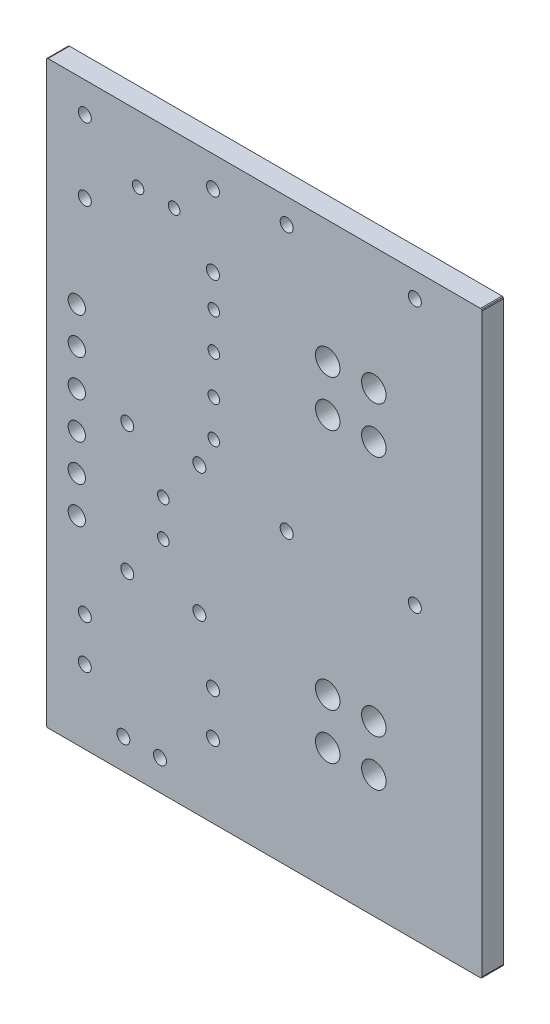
ISO-10303-21;
HEADER;
FILE_DESCRIPTION(('STEP AP214'),'2;1');
FILE_NAME('part.step','',(''),(''),'','','');
FILE_SCHEMA(('AUTOMOTIVE_DESIGN { 1 0 10303 214 1 1 1 1 }'));
ENDSEC;
DATA;
#1=APPLICATION_CONTEXT('core data for automotive mechanical design processes');
#2=APPLICATION_PROTOCOL_DEFINITION('international standard','automotive_design',2000,#1);
#3=PRODUCT_CONTEXT('',#1,'mechanical');
#4=PRODUCT('Part','Part','',(#3));
#5=PRODUCT_RELATED_PRODUCT_CATEGORY('part','',(#4));
#6=PRODUCT_DEFINITION_FORMATION('','',#4);
#7=PRODUCT_DEFINITION_CONTEXT('part definition',#1,'design');
#8=PRODUCT_DEFINITION('design','',#6,#7);
#9=PRODUCT_DEFINITION_SHAPE('','',#8);
#10=(LENGTH_UNIT() NAMED_UNIT(*) SI_UNIT(.MILLI.,.METRE.));
#11=(NAMED_UNIT(*) PLANE_ANGLE_UNIT() SI_UNIT($,.RADIAN.));
#12=(NAMED_UNIT(*) SI_UNIT($,.STERADIAN.) SOLID_ANGLE_UNIT());
#13=UNCERTAINTY_MEASURE_WITH_UNIT(LENGTH_MEASURE(1.E-05),#10,'distance_accuracy_value','');
#14=(GEOMETRIC_REPRESENTATION_CONTEXT(3) GLOBAL_UNCERTAINTY_ASSIGNED_CONTEXT((#13)) GLOBAL_UNIT_ASSIGNED_CONTEXT((#10,
#11,#12)) REPRESENTATION_CONTEXT('',''));
#15=CARTESIAN_POINT('',(0.,0.,0.));
#16=DIRECTION('',(0.,0.,1.));
#17=DIRECTION('',(1.,0.,0.));
#18=AXIS2_PLACEMENT_3D('',#15,#16,#17);
#19=CARTESIAN_POINT('',(-0.10865104,0.,0.));
#20=DIRECTION('',(0.,0.,-1.));
#21=DIRECTION('',(-1.,0.,0.));
#22=AXIS2_PLACEMENT_3D('',#19,#20,#21);
#23=PLANE('',#22);
#24=CARTESIAN_POINT('',(25.44500118,38.3999994,0.));
#25=DIRECTION('',(0.,0.,-1.));
#26=DIRECTION('',(-1.,0.,0.));
#27=AXIS2_PLACEMENT_3D('',#24,#25,#26);
#28=CIRCLE('',#27,0.4499991);
#29=CARTESIAN_POINT('',(25.89500028,38.3999994,0.));
#30=VERTEX_POINT('',#29);
#31=EDGE_CURVE('E566',#30,#30,#28,.F.);
#32=ORIENTED_EDGE('',*,*,#31,.T.);
#33=EDGE_LOOP('',(#32));
#34=FACE_BOUND('',#33,.T.);
#35=CARTESIAN_POINT('',(22.60000052,31.60000284,0.));
#36=DIRECTION('',(0.,0.,-1.));
#37=DIRECTION('',(-1.,0.,0.));
#38=AXIS2_PLACEMENT_3D('',#35,#36,#37);
#39=CIRCLE('',#38,0.8499983);
#40=CARTESIAN_POINT('',(23.44999882,31.60000284,0.));
#41=VERTEX_POINT('',#40);
#42=EDGE_CURVE('E572',#41,#41,#39,.F.);
#43=ORIENTED_EDGE('',*,*,#42,.T.);
#44=EDGE_LOOP('',(#43));
#45=FACE_BOUND('',#44,.T.);
#46=CARTESIAN_POINT('',(19.3999993,31.60000284,0.));
#47=DIRECTION('',(0.,0.,-1.));
#48=DIRECTION('',(-1.,0.,0.));
#49=AXIS2_PLACEMENT_3D('',#46,#47,#48);
#50=CIRCLE('',#49,0.8499983);
#51=CARTESIAN_POINT('',(20.2499976,31.60000284,0.));
#52=VERTEX_POINT('',#51);
#53=EDGE_CURVE('E578',#52,#52,#50,.F.);
#54=ORIENTED_EDGE('',*,*,#53,.T.);
#55=EDGE_LOOP('',(#54));
#56=FACE_BOUND('',#55,.T.);
#57=CARTESIAN_POINT('',(22.60000052,28.40000162,0.));
#58=DIRECTION('',(0.,0.,-1.));
#59=DIRECTION('',(-1.,0.,0.));
#60=AXIS2_PLACEMENT_3D('',#57,#58,#59);
#61=CIRCLE('',#60,0.8499983);
#62=CARTESIAN_POINT('',(23.44999882,28.40000162,0.));
#63=VERTEX_POINT('',#62);
#64=EDGE_CURVE('E584',#63,#63,#61,.F.);
#65=ORIENTED_EDGE('',*,*,#64,.T.);
#66=EDGE_LOOP('',(#65));
#67=FACE_BOUND('',#66,.T.);
#68=CARTESIAN_POINT('',(19.3999993,28.40000162,0.));
#69=DIRECTION('',(0.,0.,-1.));
#70=DIRECTION('',(-1.,0.,0.));
#71=AXIS2_PLACEMENT_3D('',#68,#69,#70);
#72=CIRCLE('',#71,0.8499983);
#73=CARTESIAN_POINT('',(20.2499976,28.40000162,0.));
#74=VERTEX_POINT('',#73);
#75=EDGE_CURVE('E590',#74,#74,#72,.F.);
#76=ORIENTED_EDGE('',*,*,#75,.T.);
#77=EDGE_LOOP('',(#76));
#78=FACE_BOUND('',#77,.T.);
#79=CARTESIAN_POINT('',(16.55500118,38.3999994,0.));
#80=DIRECTION('',(0.,0.,-1.));
#81=DIRECTION('',(-1.,0.,0.));
#82=AXIS2_PLACEMENT_3D('',#79,#80,#81);
#83=CIRCLE('',#82,0.4499991);
#84=CARTESIAN_POINT('',(17.00500028,38.3999994,0.));
#85=VERTEX_POINT('',#84);
#86=EDGE_CURVE('E596',#85,#85,#83,.F.);
#87=ORIENTED_EDGE('',*,*,#86,.T.);
#88=EDGE_LOOP('',(#87));
#89=FACE_BOUND('',#88,.T.);
#90=CARTESIAN_POINT('',(11.44500124,38.0000002,0.));
#91=DIRECTION('',(0.,0.,-1.));
#92=DIRECTION('',(-1.,0.,0.));
#93=AXIS2_PLACEMENT_3D('',#90,#91,#92);
#94=CIRCLE('',#93,0.4499991);
#95=CARTESIAN_POINT('',(11.89500034,38.0000002,0.));
#96=VERTEX_POINT('',#95);
#97=EDGE_CURVE('E602',#96,#96,#94,.F.);
#98=ORIENTED_EDGE('',*,*,#97,.T.);
#99=EDGE_LOOP('',(#98));
#100=FACE_BOUND('',#99,.T.);
#101=CARTESIAN_POINT('',(11.44500124,33.00000004,0.));
#102=DIRECTION('',(0.,0.,-1.));
#103=DIRECTION('',(-1.,0.,0.));
#104=AXIS2_PLACEMENT_3D('',#101,#102,#103);
#105=CIRCLE('',#104,0.4499991);
#106=CARTESIAN_POINT('',(11.89500034,33.00000004,0.));
#107=VERTEX_POINT('',#106);
#108=EDGE_CURVE('E608',#107,#107,#105,.F.);
#109=ORIENTED_EDGE('',*,*,#108,.T.);
#110=EDGE_LOOP('',(#109));
#111=FACE_BOUND('',#110,.T.);
#112=CARTESIAN_POINT('',(11.49999986,28.22999942,0.));
#113=DIRECTION('',(0.,0.,-1.));
#114=DIRECTION('',(-1.,0.,0.));
#115=AXIS2_PLACEMENT_3D('',#112,#113,#114);
#116=CIRCLE('',#115,0.3999992);
#117=CARTESIAN_POINT('',(11.89999906,28.22999942,0.));
#118=VERTEX_POINT('',#117);
#119=EDGE_CURVE('E614',#118,#118,#116,.F.);
#120=ORIENTED_EDGE('',*,*,#119,.T.);
#121=EDGE_LOOP('',(#120));
#122=FACE_BOUND('',#121,.T.);
#123=CARTESIAN_POINT('',(11.49999986,30.76999942,0.));
#124=DIRECTION('',(0.,0.,-1.));
#125=DIRECTION('',(-1.,0.,0.));
#126=AXIS2_PLACEMENT_3D('',#123,#124,#125);
#127=CIRCLE('',#126,0.3999992);
#128=CARTESIAN_POINT('',(11.89999906,30.76999942,0.));
#129=VERTEX_POINT('',#128);
#130=EDGE_CURVE('E620',#129,#129,#127,.F.);
#131=ORIENTED_EDGE('',*,*,#130,.T.);
#132=EDGE_LOOP('',(#131));
#133=FACE_BOUND('',#132,.T.);
#134=CARTESIAN_POINT('',(25.44500118,20.00000064,0.));
#135=DIRECTION('',(0.,0.,-1.));
#136=DIRECTION('',(-1.,0.,0.));
#137=AXIS2_PLACEMENT_3D('',#134,#135,#136);
#138=CIRCLE('',#137,0.4499991);
#139=CARTESIAN_POINT('',(25.89500028,20.00000064,0.));
#140=VERTEX_POINT('',#139);
#141=EDGE_CURVE('E626',#140,#140,#138,.F.);
#142=ORIENTED_EDGE('',*,*,#141,.T.);
#143=EDGE_LOOP('',(#142));
#144=FACE_BOUND('',#143,.T.);
#145=CARTESIAN_POINT('',(22.60000052,11.6000022,0.));
#146=DIRECTION('',(0.,0.,-1.));
#147=DIRECTION('',(-1.,0.,0.));
#148=AXIS2_PLACEMENT_3D('',#145,#146,#147);
#149=CIRCLE('',#148,0.8499983);
#150=CARTESIAN_POINT('',(23.44999882,11.6000022,0.));
#151=VERTEX_POINT('',#150);
#152=EDGE_CURVE('E632',#151,#151,#149,.F.);
#153=ORIENTED_EDGE('',*,*,#152,.T.);
#154=EDGE_LOOP('',(#153));
#155=FACE_BOUND('',#154,.T.);
#156=CARTESIAN_POINT('',(19.3999993,11.6000022,0.));
#157=DIRECTION('',(0.,0.,-1.));
#158=DIRECTION('',(-1.,0.,0.));
#159=AXIS2_PLACEMENT_3D('',#156,#157,#158);
#160=CIRCLE('',#159,0.8499983);
#161=CARTESIAN_POINT('',(20.2499976,11.6000022,0.));
#162=VERTEX_POINT('',#161);
#163=EDGE_CURVE('E638',#162,#162,#160,.F.);
#164=ORIENTED_EDGE('',*,*,#163,.T.);
#165=EDGE_LOOP('',(#164));
#166=FACE_BOUND('',#165,.T.);
#167=CARTESIAN_POINT('',(22.60000052,8.40000098,0.));
#168=DIRECTION('',(0.,0.,-1.));
#169=DIRECTION('',(-1.,0.,0.));
#170=AXIS2_PLACEMENT_3D('',#167,#168,#169);
#171=CIRCLE('',#170,0.8499983);
#172=CARTESIAN_POINT('',(23.44999882,8.40000098,0.));
#173=VERTEX_POINT('',#172);
#174=EDGE_CURVE('E644',#173,#173,#171,.F.);
#175=ORIENTED_EDGE('',*,*,#174,.T.);
#176=EDGE_LOOP('',(#175));
#177=FACE_BOUND('',#176,.T.);
#178=CARTESIAN_POINT('',(19.3999993,8.40000098,0.));
#179=DIRECTION('',(0.,0.,-1.));
#180=DIRECTION('',(-1.,0.,0.));
#181=AXIS2_PLACEMENT_3D('',#178,#179,#180);
#182=CIRCLE('',#181,0.8499983);
#183=CARTESIAN_POINT('',(20.2499976,8.40000098,0.));
#184=VERTEX_POINT('',#183);
#185=EDGE_CURVE('E650',#184,#184,#182,.F.);
#186=ORIENTED_EDGE('',*,*,#185,.T.);
#187=EDGE_LOOP('',(#186));
#188=FACE_BOUND('',#187,.T.);
#189=CARTESIAN_POINT('',(11.49999986,22.97999976,0.));
#190=DIRECTION('',(0.,0.,-1.));
#191=DIRECTION('',(-1.,0.,0.));
#192=AXIS2_PLACEMENT_3D('',#189,#190,#191);
#193=CIRCLE('',#192,0.3999992);
#194=CARTESIAN_POINT('',(11.89999906,22.97999976,0.));
#195=VERTEX_POINT('',#194);
#196=EDGE_CURVE('E656',#195,#195,#193,.F.);
#197=ORIENTED_EDGE('',*,*,#196,.T.);
#198=EDGE_LOOP('',(#197));
#199=FACE_BOUND('',#198,.T.);
#200=CARTESIAN_POINT('',(16.55500118,20.00000064,0.));
#201=DIRECTION('',(0.,0.,-1.));
#202=DIRECTION('',(-1.,0.,0.));
#203=AXIS2_PLACEMENT_3D('',#200,#201,#202);
#204=CIRCLE('',#203,0.4499991);
#205=CARTESIAN_POINT('',(17.00500028,20.00000064,0.));
#206=VERTEX_POINT('',#205);
#207=EDGE_CURVE('E662',#206,#206,#204,.F.);
#208=ORIENTED_EDGE('',*,*,#207,.T.);
#209=EDGE_LOOP('',(#208));
#210=FACE_BOUND('',#209,.T.);
#211=CARTESIAN_POINT('',(11.49999986,25.51999976,0.));
#212=DIRECTION('',(0.,0.,-1.));
#213=DIRECTION('',(-1.,0.,0.));
#214=AXIS2_PLACEMENT_3D('',#211,#212,#213);
#215=CIRCLE('',#214,0.3999992);
#216=CARTESIAN_POINT('',(11.89999906,25.51999976,0.));
#217=VERTEX_POINT('',#216);
#218=EDGE_CURVE('E668',#217,#217,#215,.F.);
#219=ORIENTED_EDGE('',*,*,#218,.T.);
#220=EDGE_LOOP('',(#219));
#221=FACE_BOUND('',#220,.T.);
#222=CARTESIAN_POINT('',(11.44500124,5.00000016,0.));
#223=DIRECTION('',(0.,0.,-1.));
#224=DIRECTION('',(-1.,0.,0.));
#225=AXIS2_PLACEMENT_3D('',#222,#223,#224);
#226=CIRCLE('',#225,0.4499991);
#227=CARTESIAN_POINT('',(11.89500034,5.00000016,0.));
#228=VERTEX_POINT('',#227);
#229=EDGE_CURVE('E674',#228,#228,#226,.F.);
#230=ORIENTED_EDGE('',*,*,#229,.T.);
#231=EDGE_LOOP('',(#230));
#232=FACE_BOUND('',#231,.T.);
#233=CARTESIAN_POINT('',(11.44500124,7.99999924,0.));
#234=DIRECTION('',(0.,0.,-1.));
#235=DIRECTION('',(-1.,0.,0.));
#236=AXIS2_PLACEMENT_3D('',#233,#234,#235);
#237=CIRCLE('',#236,0.4499991);
#238=CARTESIAN_POINT('',(11.89500034,7.99999924,0.));
#239=VERTEX_POINT('',#238);
#240=EDGE_CURVE('E680',#239,#239,#237,.F.);
#241=ORIENTED_EDGE('',*,*,#240,.T.);
#242=EDGE_LOOP('',(#241));
#243=FACE_BOUND('',#242,.T.);
#244=CARTESIAN_POINT('',(6.2500002,35.50000012,0.));
#245=DIRECTION('',(0.,0.,-1.));
#246=DIRECTION('',(-1.,0.,0.));
#247=AXIS2_PLACEMENT_3D('',#244,#245,#246);
#248=CIRCLE('',#247,0.3999992);
#249=CARTESIAN_POINT('',(6.6499994,35.50000012,0.));
#250=VERTEX_POINT('',#249);
#251=EDGE_CURVE('E686',#250,#250,#248,.F.);
#252=ORIENTED_EDGE('',*,*,#251,.T.);
#253=EDGE_LOOP('',(#252));
#254=FACE_BOUND('',#253,.T.);
#255=CARTESIAN_POINT('',(8.75000028,35.50000012,0.));
#256=DIRECTION('',(0.,0.,-1.));
#257=DIRECTION('',(-1.,0.,0.));
#258=AXIS2_PLACEMENT_3D('',#255,#256,#257);
#259=CIRCLE('',#258,0.3999992);
#260=CARTESIAN_POINT('',(9.14999948,35.50000012,0.));
#261=VERTEX_POINT('',#260);
#262=EDGE_CURVE('E692',#261,#261,#259,.F.);
#263=ORIENTED_EDGE('',*,*,#262,.T.);
#264=EDGE_LOOP('',(#263));
#265=FACE_BOUND('',#264,.T.);
#266=CARTESIAN_POINT('',(2.55500124,33.00000004,0.));
#267=DIRECTION('',(0.,0.,-1.));
#268=DIRECTION('',(-1.,0.,0.));
#269=AXIS2_PLACEMENT_3D('',#266,#267,#268);
#270=CIRCLE('',#269,0.4499991);
#271=CARTESIAN_POINT('',(3.00500034,33.00000004,0.));
#272=VERTEX_POINT('',#271);
#273=EDGE_CURVE('E698',#272,#272,#270,.F.);
#274=ORIENTED_EDGE('',*,*,#273,.T.);
#275=EDGE_LOOP('',(#274));
#276=FACE_BOUND('',#275,.T.);
#277=CARTESIAN_POINT('',(10.49999932,20.94500002,0.));
#278=DIRECTION('',(0.,0.,-1.));
#279=DIRECTION('',(-1.,0.,0.));
#280=AXIS2_PLACEMENT_3D('',#277,#278,#279);
#281=CIRCLE('',#280,0.4499991);
#282=CARTESIAN_POINT('',(10.94999842,20.94500002,0.));
#283=VERTEX_POINT('',#282);
#284=EDGE_CURVE('E704',#283,#283,#281,.F.);
#285=ORIENTED_EDGE('',*,*,#284,.T.);
#286=EDGE_LOOP('',(#285));
#287=FACE_BOUND('',#286,.T.);
#288=CARTESIAN_POINT('',(5.49999916,20.94500002,0.));
#289=DIRECTION('',(0.,0.,-1.));
#290=DIRECTION('',(-1.,0.,0.));
#291=AXIS2_PLACEMENT_3D('',#288,#289,#290);
#292=CIRCLE('',#291,0.4499991);
#293=CARTESIAN_POINT('',(5.94999826,20.94500002,0.));
#294=VERTEX_POINT('',#293);
#295=EDGE_CURVE('E710',#294,#294,#292,.F.);
#296=ORIENTED_EDGE('',*,*,#295,.T.);
#297=EDGE_LOOP('',(#296));
#298=FACE_BOUND('',#297,.T.);
#299=CARTESIAN_POINT('',(2.55500124,38.0000002,0.));
#300=DIRECTION('',(0.,0.,-1.));
#301=DIRECTION('',(-1.,0.,0.));
#302=AXIS2_PLACEMENT_3D('',#299,#300,#301);
#303=CIRCLE('',#302,0.4499991);
#304=CARTESIAN_POINT('',(3.00500034,38.0000002,0.));
#305=VERTEX_POINT('',#304);
#306=EDGE_CURVE('E716',#305,#305,#303,.F.);
#307=ORIENTED_EDGE('',*,*,#306,.T.);
#308=EDGE_LOOP('',(#307));
#309=FACE_BOUND('',#308,.T.);
#310=CARTESIAN_POINT('',(2.00000108,26.35000064,0.));
#311=DIRECTION('',(0.,0.,-1.));
#312=DIRECTION('',(-1.,0.,0.));
#313=AXIS2_PLACEMENT_3D('',#310,#311,#312);
#314=CIRCLE('',#313,0.5999988);
#315=CARTESIAN_POINT('',(2.59999988,26.35000064,0.));
#316=VERTEX_POINT('',#315);
#317=EDGE_CURVE('E722',#316,#316,#314,.F.);
#318=ORIENTED_EDGE('',*,*,#317,.T.);
#319=EDGE_LOOP('',(#318));
#320=FACE_BOUND('',#319,.T.);
#321=CARTESIAN_POINT('',(2.00000108,23.81000064,0.));
#322=DIRECTION('',(0.,0.,-1.));
#323=DIRECTION('',(-1.,0.,0.));
#324=AXIS2_PLACEMENT_3D('',#321,#322,#323);
#325=CIRCLE('',#324,0.5999988);
#326=CARTESIAN_POINT('',(2.59999988,23.81000064,0.));
#327=VERTEX_POINT('',#326);
#328=EDGE_CURVE('E728',#327,#327,#325,.F.);
#329=ORIENTED_EDGE('',*,*,#328,.T.);
#330=EDGE_LOOP('',(#329));
#331=FACE_BOUND('',#330,.T.);
#332=CARTESIAN_POINT('',(2.00000108,18.73000064,0.));
#333=DIRECTION('',(0.,0.,-1.));
#334=DIRECTION('',(-1.,0.,0.));
#335=AXIS2_PLACEMENT_3D('',#332,#333,#334);
#336=CIRCLE('',#335,0.5999988);
#337=CARTESIAN_POINT('',(2.59999988,18.73000064,0.));
#338=VERTEX_POINT('',#337);
#339=EDGE_CURVE('E734',#338,#338,#336,.F.);
#340=ORIENTED_EDGE('',*,*,#339,.T.);
#341=EDGE_LOOP('',(#340));
#342=FACE_BOUND('',#341,.T.);
#343=CARTESIAN_POINT('',(2.00000108,21.27000064,0.));
#344=DIRECTION('',(0.,0.,-1.));
#345=DIRECTION('',(-1.,0.,0.));
#346=AXIS2_PLACEMENT_3D('',#343,#344,#345);
#347=CIRCLE('',#346,0.5999988);
#348=CARTESIAN_POINT('',(2.59999988,21.27000064,0.));
#349=VERTEX_POINT('',#348);
#350=EDGE_CURVE('E740',#349,#349,#347,.F.);
#351=ORIENTED_EDGE('',*,*,#350,.T.);
#352=EDGE_LOOP('',(#351));
#353=FACE_BOUND('',#352,.T.);
#354=CARTESIAN_POINT('',(7.99999924,15.24999998,0.));
#355=DIRECTION('',(0.,0.,-1.));
#356=DIRECTION('',(-1.,0.,0.));
#357=AXIS2_PLACEMENT_3D('',#354,#355,#356);
#358=CIRCLE('',#357,0.3999992);
#359=CARTESIAN_POINT('',(8.39999844,15.24999998,0.));
#360=VERTEX_POINT('',#359);
#361=EDGE_CURVE('E746',#360,#360,#358,.F.);
#362=ORIENTED_EDGE('',*,*,#361,.T.);
#363=EDGE_LOOP('',(#362));
#364=FACE_BOUND('',#363,.T.);
#365=CARTESIAN_POINT('',(10.49999932,12.05500002,0.));
#366=DIRECTION('',(0.,0.,-1.));
#367=DIRECTION('',(-1.,0.,0.));
#368=AXIS2_PLACEMENT_3D('',#365,#366,#367);
#369=CIRCLE('',#368,0.4499991);
#370=CARTESIAN_POINT('',(10.94999842,12.05500002,0.));
#371=VERTEX_POINT('',#370);
#372=EDGE_CURVE('E752',#371,#371,#369,.F.);
#373=ORIENTED_EDGE('',*,*,#372,.T.);
#374=EDGE_LOOP('',(#373));
#375=FACE_BOUND('',#374,.T.);
#376=CARTESIAN_POINT('',(7.99999924,17.75000006,0.));
#377=DIRECTION('',(0.,0.,-1.));
#378=DIRECTION('',(-1.,0.,0.));
#379=AXIS2_PLACEMENT_3D('',#376,#377,#378);
#380=CIRCLE('',#379,0.3999992);
#381=CARTESIAN_POINT('',(8.39999844,17.75000006,0.));
#382=VERTEX_POINT('',#381);
#383=EDGE_CURVE('E758',#382,#382,#380,.F.);
#384=ORIENTED_EDGE('',*,*,#383,.T.);
#385=EDGE_LOOP('',(#384));
#386=FACE_BOUND('',#385,.T.);
#387=CARTESIAN_POINT('',(7.7699997,2.00000108,0.));
#388=DIRECTION('',(0.,0.,-1.));
#389=DIRECTION('',(-1.,0.,0.));
#390=AXIS2_PLACEMENT_3D('',#387,#388,#389);
#391=CIRCLE('',#390,0.4499991);
#392=CARTESIAN_POINT('',(8.2199988,2.00000108,0.));
#393=VERTEX_POINT('',#392);
#394=EDGE_CURVE('E764',#393,#393,#391,.F.);
#395=ORIENTED_EDGE('',*,*,#394,.T.);
#396=EDGE_LOOP('',(#395));
#397=FACE_BOUND('',#396,.T.);
#398=CARTESIAN_POINT('',(5.49999916,12.05500002,0.));
#399=DIRECTION('',(0.,0.,-1.));
#400=DIRECTION('',(-1.,0.,0.));
#401=AXIS2_PLACEMENT_3D('',#398,#399,#400);
#402=CIRCLE('',#401,0.4499991);
#403=CARTESIAN_POINT('',(5.94999826,12.05500002,0.));
#404=VERTEX_POINT('',#403);
#405=EDGE_CURVE('E770',#404,#404,#402,.F.);
#406=ORIENTED_EDGE('',*,*,#405,.T.);
#407=EDGE_LOOP('',(#406));
#408=FACE_BOUND('',#407,.T.);
#409=CARTESIAN_POINT('',(2.00000108,13.65000064,0.));
#410=DIRECTION('',(0.,0.,-1.));
#411=DIRECTION('',(-1.,0.,0.));
#412=AXIS2_PLACEMENT_3D('',#409,#410,#411);
#413=CIRCLE('',#412,0.5999988);
#414=CARTESIAN_POINT('',(2.59999988,13.65000064,0.));
#415=VERTEX_POINT('',#414);
#416=EDGE_CURVE('E776',#415,#415,#413,.F.);
#417=ORIENTED_EDGE('',*,*,#416,.T.);
#418=EDGE_LOOP('',(#417));
#419=FACE_BOUND('',#418,.T.);
#420=CARTESIAN_POINT('',(2.55500124,7.99999924,0.));
#421=DIRECTION('',(0.,0.,-1.));
#422=DIRECTION('',(-1.,0.,0.));
#423=AXIS2_PLACEMENT_3D('',#420,#421,#422);
#424=CIRCLE('',#423,0.4499991);
#425=CARTESIAN_POINT('',(3.00500034,7.99999924,0.));
#426=VERTEX_POINT('',#425);
#427=EDGE_CURVE('E782',#426,#426,#424,.F.);
#428=ORIENTED_EDGE('',*,*,#427,.T.);
#429=EDGE_LOOP('',(#428));
#430=FACE_BOUND('',#429,.T.);
#431=CARTESIAN_POINT('',(2.00000108,16.19000064,0.));
#432=DIRECTION('',(0.,0.,-1.));
#433=DIRECTION('',(-1.,0.,0.));
#434=AXIS2_PLACEMENT_3D('',#431,#432,#433);
#435=CIRCLE('',#434,0.5999988);
#436=CARTESIAN_POINT('',(2.59999988,16.19000064,0.));
#437=VERTEX_POINT('',#436);
#438=EDGE_CURVE('E788',#437,#437,#435,.F.);
#439=ORIENTED_EDGE('',*,*,#438,.T.);
#440=EDGE_LOOP('',(#439));
#441=FACE_BOUND('',#440,.T.);
#442=CARTESIAN_POINT('',(5.2299997,2.00000108,0.));
#443=DIRECTION('',(0.,0.,-1.));
#444=DIRECTION('',(-1.,0.,0.));
#445=AXIS2_PLACEMENT_3D('',#442,#443,#444);
#446=CIRCLE('',#445,0.4499991);
#447=CARTESIAN_POINT('',(5.6799988,2.00000108,0.));
#448=VERTEX_POINT('',#447);
#449=EDGE_CURVE('E794',#448,#448,#446,.F.);
#450=ORIENTED_EDGE('',*,*,#449,.T.);
#451=EDGE_LOOP('',(#450));
#452=FACE_BOUND('',#451,.T.);
#453=CARTESIAN_POINT('',(2.55500124,5.00000016,0.));
#454=DIRECTION('',(0.,0.,-1.));
#455=DIRECTION('',(-1.,0.,0.));
#456=AXIS2_PLACEMENT_3D('',#453,#454,#455);
#457=CIRCLE('',#456,0.4499991);
#458=CARTESIAN_POINT('',(3.00500034,5.00000016,0.));
#459=VERTEX_POINT('',#458);
#460=EDGE_CURVE('E19',#459,#459,#457,.F.);
#461=ORIENTED_EDGE('',*,*,#460,.T.);
#462=EDGE_LOOP('',(#461));
#463=FACE_BOUND('',#462,.T.);
#464=DIRECTION('',(-0.956078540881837,0.29311059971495,0.));
#465=VECTOR('',#464,1.);
#466=CARTESIAN_POINT('',(-0.07682738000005,-0.07682738,0.));
#467=LINE('',#466,#465);
#468=CARTESIAN_POINT('',(0.,-0.100380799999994,0.));
#469=VERTEX_POINT('',#468);
#470=CARTESIAN_POINT('',(-0.0768273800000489,-0.0768273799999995,0.));
#471=VERTEX_POINT('',#470);
#472=EDGE_CURVE('E400',#469,#471,#467,.T.);
#473=ORIENTED_EDGE('',*,*,#472,.T.);
#474=DIRECTION('',(-0.382690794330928,0.923876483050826,0.));
#475=VECTOR('',#474,1.);
#476=CARTESIAN_POINT('',(-0.10865104,0.,0.));
#477=LINE('',#476,#475);
#478=CARTESIAN_POINT('',(-0.10865104,0.,0.));
#479=VERTEX_POINT('',#478);
#480=EDGE_CURVE('E348',#471,#479,#477,.T.);
#481=ORIENTED_EDGE('',*,*,#480,.T.);
#482=DIRECTION('',(0.000206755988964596,0.99999997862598,0.));
#483=VECTOR('',#482,1.);
#484=CARTESIAN_POINT('',(-0.1003808,40.00000128,0.));
#485=LINE('',#484,#483);
#486=CARTESIAN_POINT('',(-0.100380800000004,40.00000128,0.));
#487=VERTEX_POINT('',#486);
#488=EDGE_CURVE('E448',#479,#487,#485,.T.);
#489=ORIENTED_EDGE('',*,*,#488,.T.);
#490=DIRECTION('',(0.29311059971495,0.956078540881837,0.));
#491=VECTOR('',#490,1.);
#492=CARTESIAN_POINT('',(-0.07682738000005,40.07682866,0.));
#493=LINE('',#492,#491);
#494=CARTESIAN_POINT('',(-0.0768273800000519,40.07682866,0.));
#495=VERTEX_POINT('',#494);
#496=EDGE_CURVE('E443',#487,#495,#493,.T.);
#497=ORIENTED_EDGE('',*,*,#496,.T.);
#498=DIRECTION('',(0.923876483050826,0.382690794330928,0.));
#499=VECTOR('',#498,1.);
#500=CARTESIAN_POINT('',(0.,40.10865232,0.));
#501=LINE('',#500,#499);
#502=CARTESIAN_POINT('',(0.,40.10865232,0.));
#503=VERTEX_POINT('',#502);
#504=EDGE_CURVE('E438',#495,#503,#501,.T.);
#505=ORIENTED_EDGE('',*,*,#504,.T.);
#506=DIRECTION('',(0.999999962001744,-0.000275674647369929,0.));
#507=VECTOR('',#506,1.);
#508=CARTESIAN_POINT('',(30.00000096,40.10038208,0.));
#509=LINE('',#508,#507);
#510=CARTESIAN_POINT('',(30.00000096,40.10038208,0.));
#511=VERTEX_POINT('',#510);
#512=EDGE_CURVE('E433',#503,#511,#509,.T.);
#513=ORIENTED_EDGE('',*,*,#512,.T.);
#514=DIRECTION('',(0.95606968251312,-0.293139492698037,0.));
#515=VECTOR('',#514,1.);
#516=CARTESIAN_POINT('',(30.07682834,40.07682612,0.));
#517=LINE('',#516,#515);
#518=CARTESIAN_POINT('',(30.07682834,40.07682612,0.));
#519=VERTEX_POINT('',#518);
#520=EDGE_CURVE('E428',#511,#519,#517,.T.);
#521=ORIENTED_EDGE('',*,*,#520,.T.);
#522=DIRECTION('',(0.382701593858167,-0.923872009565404,0.));
#523=VECTOR('',#522,1.);
#524=CARTESIAN_POINT('',(30.108652,40.00000128,0.));
#525=LINE('',#524,#523);
#526=CARTESIAN_POINT('',(30.108652,40.00000128,0.));
#527=VERTEX_POINT('',#526);
#528=EDGE_CURVE('E423',#519,#527,#525,.T.);
#529=ORIENTED_EDGE('',*,*,#528,.T.);
#530=DIRECTION('',(-0.000206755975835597,-0.999999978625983,0.));
#531=VECTOR('',#530,1.);
#532=CARTESIAN_POINT('',(30.10038176,-2.539999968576E-06,0.));
#533=LINE('',#532,#531);
#534=CARTESIAN_POINT('',(30.10038176,-2.53999997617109E-06,0.));
#535=VERTEX_POINT('',#534);
#536=EDGE_CURVE('E418',#527,#535,#533,.T.);
#537=ORIENTED_EDGE('',*,*,#536,.T.);
#538=DIRECTION('',(-0.29311059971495,-0.956078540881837,0.));
#539=VECTOR('',#538,1.);
#540=CARTESIAN_POINT('',(30.07682834,-0.07682991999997,0.));
#541=LINE('',#540,#539);
#542=CARTESIAN_POINT('',(30.07682834,-0.076829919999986,0.));
#543=VERTEX_POINT('',#542);
#544=EDGE_CURVE('E413',#535,#543,#541,.T.);
#545=ORIENTED_EDGE('',*,*,#544,.T.);
#546=DIRECTION('',(-0.923876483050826,-0.382690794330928,0.));
#547=VECTOR('',#546,1.);
#548=CARTESIAN_POINT('',(30.00000096,-0.10865358,0.));
#549=LINE('',#548,#547);
#550=CARTESIAN_POINT('',(30.00000096,-0.108653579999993,0.));
#551=VERTEX_POINT('',#550);
#552=EDGE_CURVE('E408',#543,#551,#549,.T.);
#553=ORIENTED_EDGE('',*,*,#552,.T.);
#554=DIRECTION('',(-0.9999999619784,0.00027575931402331,0.));
#555=VECTOR('',#554,1.);
#556=CARTESIAN_POINT('',(0.,-0.1003808,0.));
#557=LINE('',#556,#555);
#558=EDGE_CURVE('E403',#551,#469,#557,.T.);
#559=ORIENTED_EDGE('',*,*,#558,.T.);
#560=EDGE_LOOP('',(#473,#481,#489,#497,#505,#513,#521,#529,#537,#545,#553,#559));
#561=FACE_BOUND('',#560,.T.);
#562=ADVANCED_FACE('F16',(#34,#45,#56,#67,#78,#89,#100,#111,#122,#133,#144,#155,#166,#177,#188,
#199,#210,#221,#232,#243,#254,#265,#276,#287,#298,#309,#320,#331,#342,#353,#364,#375,#386,#397,
#408,#419,#430,#441,#452,#463,#561),#23,.T.);
#563=CARTESIAN_POINT('',(-0.1003808,40.00000128,0.));
#564=DIRECTION('',(0.99999997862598,-0.000206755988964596,0.));
#565=DIRECTION('',(0.000206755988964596,0.99999997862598,0.));
#566=AXIS2_PLACEMENT_3D('',#563,#564,#565);
#567=PLANE('',#566);
#568=DIRECTION('',(0.,0.,1.));
#569=VECTOR('',#568,1.);
#570=CARTESIAN_POINT('',(-0.10865104,0.,0.));
#571=LINE('',#570,#569);
#572=CARTESIAN_POINT('',(-0.10865104,0.,1.49143974));
#573=VERTEX_POINT('',#572);
#574=EDGE_CURVE('E352',#479,#573,#571,.T.);
#575=ORIENTED_EDGE('',*,*,#574,.T.);
#576=DIRECTION('',(0.000206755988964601,0.99999997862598,0.));
#577=VECTOR('',#576,1.);
#578=CARTESIAN_POINT('',(-0.10865104,0.,1.49143974));
#579=LINE('',#578,#577);
#580=CARTESIAN_POINT('',(-0.100380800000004,40.00000128,1.49143974));
#581=VERTEX_POINT('',#580);
#582=EDGE_CURVE('E362',#573,#581,#579,.T.);
#583=ORIENTED_EDGE('',*,*,#582,.T.);
#584=DIRECTION('',(0.,0.,1.));
#585=VECTOR('',#584,1.);
#586=CARTESIAN_POINT('',(-0.100380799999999,40.00000128,0.));
#587=LINE('',#586,#585);
#588=EDGE_CURVE('E445',#581,#487,#587,.F.);
#589=ORIENTED_EDGE('',*,*,#588,.T.);
#590=ORIENTED_EDGE('',*,*,#488,.F.);
#591=EDGE_LOOP('',(#575,#583,#589,#590));
#592=FACE_BOUND('',#591,.T.);
#593=ADVANCED_FACE('F981',(#592),#567,.F.);
#594=CARTESIAN_POINT('',(-0.07682738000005,40.07682866,0.));
#595=DIRECTION('',(0.956078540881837,-0.29311059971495,0.));
#596=DIRECTION('',(0.29311059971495,0.956078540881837,0.));
#597=AXIS2_PLACEMENT_3D('',#594,#595,#596);
#598=PLANE('',#597);
#599=ORIENTED_EDGE('',*,*,#588,.F.);
#600=DIRECTION('',(0.293110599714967,0.956078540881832,0.));
#601=VECTOR('',#600,1.);
#602=CARTESIAN_POINT('',(-0.1003808,40.00000128,1.49143974));
#603=LINE('',#602,#601);
#604=CARTESIAN_POINT('',(-0.0768273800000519,40.07682866,1.49143974));
#605=VERTEX_POINT('',#604);
#606=EDGE_CURVE('E393',#581,#605,#603,.T.);
#607=ORIENTED_EDGE('',*,*,#606,.T.);
#608=DIRECTION('',(0.,0.,1.));
#609=VECTOR('',#608,1.);
#610=CARTESIAN_POINT('',(-0.0768273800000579,40.07682866,0.));
#611=LINE('',#610,#609);
#612=EDGE_CURVE('E440',#605,#495,#611,.F.);
#613=ORIENTED_EDGE('',*,*,#612,.T.);
#614=ORIENTED_EDGE('',*,*,#496,.F.);
#615=EDGE_LOOP('',(#599,#607,#613,#614));
#616=FACE_BOUND('',#615,.T.);
#617=ADVANCED_FACE('F986',(#616),#598,.F.);
#618=CARTESIAN_POINT('',(0.,40.10865232,0.));
#619=DIRECTION('',(0.382690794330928,-0.923876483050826,0.));
#620=DIRECTION('',(0.923876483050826,0.382690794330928,0.));
#621=AXIS2_PLACEMENT_3D('',#618,#619,#620);
#622=PLANE('',#621);
#623=ORIENTED_EDGE('',*,*,#612,.F.);
#624=DIRECTION('',(0.923876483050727,0.382690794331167,0.));
#625=VECTOR('',#624,1.);
#626=CARTESIAN_POINT('',(-0.07682738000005,40.07682866,1.49143974));
#627=LINE('',#626,#625);
#628=CARTESIAN_POINT('',(0.,40.10865232,1.49143974));
#629=VERTEX_POINT('',#628);
#630=EDGE_CURVE('E390',#605,#629,#627,.T.);
#631=ORIENTED_EDGE('',*,*,#630,.T.);
#632=DIRECTION('',(0.,0.,1.));
#633=VECTOR('',#632,1.);
#634=CARTESIAN_POINT('',(0.,40.10865232,0.));
#635=LINE('',#634,#633);
#636=EDGE_CURVE('E435',#629,#503,#635,.F.);
#637=ORIENTED_EDGE('',*,*,#636,.T.);
#638=ORIENTED_EDGE('',*,*,#504,.F.);
#639=EDGE_LOOP('',(#623,#631,#637,#638));
#640=FACE_BOUND('',#639,.T.);
#641=ADVANCED_FACE('F1100',(#640),#622,.F.);
#642=CARTESIAN_POINT('',(30.00000096,40.10038208,0.));
#643=DIRECTION('',(-0.000275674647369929,-0.999999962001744,0.));
#644=DIRECTION('',(0.999999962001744,-0.000275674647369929,0.));
#645=AXIS2_PLACEMENT_3D('',#642,#643,#644);
#646=PLANE('',#645);
#647=ORIENTED_EDGE('',*,*,#636,.F.);
#648=DIRECTION('',(0.999999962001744,-0.000275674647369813,0.));
#649=VECTOR('',#648,1.);
#650=CARTESIAN_POINT('',(0.,40.10865232,1.49143974));
#651=LINE('',#650,#649);
#652=CARTESIAN_POINT('',(30.00000096,40.10038208,1.49143974));
#653=VERTEX_POINT('',#652);
#654=EDGE_CURVE('E387',#629,#653,#651,.T.);
#655=ORIENTED_EDGE('',*,*,#654,.T.);
#656=DIRECTION('',(0.,0.,1.));
#657=VECTOR('',#656,1.);
#658=CARTESIAN_POINT('',(30.00000096,40.10038208,0.));
#659=LINE('',#658,#657);
#660=EDGE_CURVE('E430',#653,#511,#659,.F.);
#661=ORIENTED_EDGE('',*,*,#660,.T.);
#662=ORIENTED_EDGE('',*,*,#512,.F.);
#663=EDGE_LOOP('',(#647,#655,#661,#662));
#664=FACE_BOUND('',#663,.T.);
#665=ADVANCED_FACE('F1106',(#664),#646,.F.);
#666=CARTESIAN_POINT('',(30.07682834,40.07682612,0.));
#667=DIRECTION('',(-0.293139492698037,-0.95606968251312,0.));
#668=DIRECTION('',(0.95606968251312,-0.293139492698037,0.));
#669=AXIS2_PLACEMENT_3D('',#666,#667,#668);
#670=PLANE('',#669);
#671=ORIENTED_EDGE('',*,*,#660,.F.);
#672=DIRECTION('',(0.956069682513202,-0.293139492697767,0.));
#673=VECTOR('',#672,1.);
#674=CARTESIAN_POINT('',(30.00000096,40.10038208,1.49143974));
#675=LINE('',#674,#673);
#676=CARTESIAN_POINT('',(30.07682834,40.07682612,1.49143974));
#677=VERTEX_POINT('',#676);
#678=EDGE_CURVE('E384',#653,#677,#675,.T.);
#679=ORIENTED_EDGE('',*,*,#678,.T.);
#680=DIRECTION('',(0.,0.,1.));
#681=VECTOR('',#680,1.);
#682=CARTESIAN_POINT('',(30.07682834,40.07682612,0.));
#683=LINE('',#682,#681);
#684=EDGE_CURVE('E425',#677,#519,#683,.F.);
#685=ORIENTED_EDGE('',*,*,#684,.T.);
#686=ORIENTED_EDGE('',*,*,#520,.F.);
#687=EDGE_LOOP('',(#671,#679,#685,#686));
#688=FACE_BOUND('',#687,.T.);
#689=ADVANCED_FACE('F1110',(#688),#670,.F.);
#690=CARTESIAN_POINT('',(30.108652,40.00000128,0.));
#691=DIRECTION('',(-0.923872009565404,-0.382701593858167,0.));
#692=DIRECTION('',(0.382701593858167,-0.923872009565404,0.));
#693=AXIS2_PLACEMENT_3D('',#690,#691,#692);
#694=PLANE('',#693);
#695=ORIENTED_EDGE('',*,*,#684,.F.);
#696=DIRECTION('',(0.382701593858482,-0.923872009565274,0.));
#697=VECTOR('',#696,1.);
#698=CARTESIAN_POINT('',(30.07682834,40.07682612,1.49143974));
#699=LINE('',#698,#697);
#700=CARTESIAN_POINT('',(30.108652,40.00000128,1.49143974));
#701=VERTEX_POINT('',#700);
#702=EDGE_CURVE('E381',#677,#701,#699,.T.);
#703=ORIENTED_EDGE('',*,*,#702,.T.);
#704=DIRECTION('',(0.,0.,1.));
#705=VECTOR('',#704,1.);
#706=CARTESIAN_POINT('',(30.108652,40.00000128,0.));
#707=LINE('',#706,#705);
#708=EDGE_CURVE('E420',#701,#527,#707,.F.);
#709=ORIENTED_EDGE('',*,*,#708,.T.);
#710=ORIENTED_EDGE('',*,*,#528,.F.);
#711=EDGE_LOOP('',(#695,#703,#709,#710));
#712=FACE_BOUND('',#711,.T.);
#713=ADVANCED_FACE('F1114',(#712),#694,.F.);
#714=CARTESIAN_POINT('',(30.10038176,-2.539999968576E-06,0.));
#715=DIRECTION('',(-0.999999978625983,0.000206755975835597,0.));
#716=DIRECTION('',(-0.000206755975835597,-0.999999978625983,0.));
#717=AXIS2_PLACEMENT_3D('',#714,#715,#716);
#718=PLANE('',#717);
#719=ORIENTED_EDGE('',*,*,#708,.F.);
#720=DIRECTION('',(-0.000206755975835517,-0.999999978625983,0.));
#721=VECTOR('',#720,1.);
#722=CARTESIAN_POINT('',(30.108652,40.00000128,1.49143974));
#723=LINE('',#722,#721);
#724=CARTESIAN_POINT('',(30.10038176,-2.53999997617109E-06,1.49143974));
#725=VERTEX_POINT('',#724);
#726=EDGE_CURVE('E378',#701,#725,#723,.T.);
#727=ORIENTED_EDGE('',*,*,#726,.T.);
#728=DIRECTION('',(0.,0.,1.));
#729=VECTOR('',#728,1.);
#730=CARTESIAN_POINT('',(30.10038176,-2.53999995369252E-06,0.));
#731=LINE('',#730,#729);
#732=EDGE_CURVE('E415',#725,#535,#731,.F.);
#733=ORIENTED_EDGE('',*,*,#732,.T.);
#734=ORIENTED_EDGE('',*,*,#536,.F.);
#735=EDGE_LOOP('',(#719,#727,#733,#734));
#736=FACE_BOUND('',#735,.T.);
#737=ADVANCED_FACE('F1118',(#736),#718,.F.);
#738=CARTESIAN_POINT('',(30.07682834,-0.07682991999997,0.));
#739=DIRECTION('',(-0.956078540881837,0.29311059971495,0.));
#740=DIRECTION('',(-0.29311059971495,-0.956078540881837,0.));
#741=AXIS2_PLACEMENT_3D('',#738,#739,#740);
#742=PLANE('',#741);
#743=ORIENTED_EDGE('',*,*,#732,.F.);
#744=DIRECTION('',(-0.293110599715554,-0.956078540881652,0.));
#745=VECTOR('',#744,1.);
#746=CARTESIAN_POINT('',(30.10038176,-2.539999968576E-06,1.49143974));
#747=LINE('',#746,#745);
#748=CARTESIAN_POINT('',(30.07682834,-0.076829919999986,1.49143974));
#749=VERTEX_POINT('',#748);
#750=EDGE_CURVE('E375',#725,#749,#747,.T.);
#751=ORIENTED_EDGE('',*,*,#750,.T.);
#752=DIRECTION('',(0.,0.,1.));
#753=VECTOR('',#752,1.);
#754=CARTESIAN_POINT('',(30.07682834,-0.0768299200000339,0.));
#755=LINE('',#754,#753);
#756=EDGE_CURVE('E410',#749,#543,#755,.F.);
#757=ORIENTED_EDGE('',*,*,#756,.T.);
#758=ORIENTED_EDGE('',*,*,#544,.F.);
#759=EDGE_LOOP('',(#743,#751,#757,#758));
#760=FACE_BOUND('',#759,.T.);
#761=ADVANCED_FACE('F1122',(#760),#742,.F.);
#762=CARTESIAN_POINT('',(30.00000096,-0.10865358,0.));
#763=DIRECTION('',(-0.382690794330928,0.923876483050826,0.));
#764=DIRECTION('',(-0.923876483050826,-0.382690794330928,0.));
#765=AXIS2_PLACEMENT_3D('',#762,#763,#764);
#766=PLANE('',#765);
#767=ORIENTED_EDGE('',*,*,#756,.F.);
#768=DIRECTION('',(-0.923876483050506,-0.382690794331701,0.));
#769=VECTOR('',#768,1.);
#770=CARTESIAN_POINT('',(30.07682834,-0.07682991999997,1.49143974));
#771=LINE('',#770,#769);
#772=CARTESIAN_POINT('',(30.00000096,-0.108653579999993,1.49143974));
#773=VERTEX_POINT('',#772);
#774=EDGE_CURVE('E370',#749,#773,#771,.T.);
#775=ORIENTED_EDGE('',*,*,#774,.T.);
#776=DIRECTION('',(0.,0.,1.));
#777=VECTOR('',#776,1.);
#778=CARTESIAN_POINT('',(30.00000096,-0.108653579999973,0.));
#779=LINE('',#778,#777);
#780=EDGE_CURVE('E405',#773,#551,#779,.F.);
#781=ORIENTED_EDGE('',*,*,#780,.T.);
#782=ORIENTED_EDGE('',*,*,#552,.F.);
#783=EDGE_LOOP('',(#767,#775,#781,#782));
#784=FACE_BOUND('',#783,.T.);
#785=ADVANCED_FACE('F1126',(#784),#766,.F.);
#786=CARTESIAN_POINT('',(0.,-0.1003808,0.));
#787=DIRECTION('',(0.00027575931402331,0.9999999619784,0.));
#788=DIRECTION('',(-0.9999999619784,0.00027575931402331,0.));
#789=AXIS2_PLACEMENT_3D('',#786,#787,#788);
#790=PLANE('',#789);
#791=ORIENTED_EDGE('',*,*,#780,.F.);
#792=DIRECTION('',(-0.9999999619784,0.000275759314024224,0.));
#793=VECTOR('',#792,1.);
#794=CARTESIAN_POINT('',(30.00000096,-0.10865358,1.49143974));
#795=LINE('',#794,#793);
#796=CARTESIAN_POINT('',(0.,-0.100380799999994,1.49143974));
#797=VERTEX_POINT('',#796);
#798=EDGE_CURVE('E368',#773,#797,#795,.T.);
#799=ORIENTED_EDGE('',*,*,#798,.T.);
#800=DIRECTION('',(0.,0.,1.));
#801=VECTOR('',#800,1.);
#802=CARTESIAN_POINT('',(0.,-0.100380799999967,0.));
#803=LINE('',#802,#801);
#804=EDGE_CURVE('E367',#797,#469,#803,.F.);
#805=ORIENTED_EDGE('',*,*,#804,.T.);
#806=ORIENTED_EDGE('',*,*,#558,.F.);
#807=EDGE_LOOP('',(#791,#799,#805,#806));
#808=FACE_BOUND('',#807,.T.);
#809=ADVANCED_FACE('F1130',(#808),#790,.F.);
#810=CARTESIAN_POINT('',(-0.07682738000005,-0.07682738,0.));
#811=DIRECTION('',(0.29311059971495,0.956078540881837,0.));
#812=DIRECTION('',(-0.956078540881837,0.29311059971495,0.));
#813=AXIS2_PLACEMENT_3D('',#810,#811,#812);
#814=PLANE('',#813);
#815=ORIENTED_EDGE('',*,*,#804,.F.);
#816=DIRECTION('',(-0.956078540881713,0.293110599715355,0.));
#817=VECTOR('',#816,1.);
#818=CARTESIAN_POINT('',(0.,-0.1003808,1.49143974));
#819=LINE('',#818,#817);
#820=CARTESIAN_POINT('',(-0.0768273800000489,-0.0768273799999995,1.49143974));
#821=VERTEX_POINT('',#820);
#822=EDGE_CURVE('E358',#797,#821,#819,.T.);
#823=ORIENTED_EDGE('',*,*,#822,.T.);
#824=DIRECTION('',(0.,0.,1.));
#825=VECTOR('',#824,1.);
#826=CARTESIAN_POINT('',(-0.0768273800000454,-0.0768273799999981,0.));
#827=LINE('',#826,#825);
#828=EDGE_CURVE('E342',#821,#471,#827,.F.);
#829=ORIENTED_EDGE('',*,*,#828,.T.);
#830=ORIENTED_EDGE('',*,*,#472,.F.);
#831=EDGE_LOOP('',(#815,#823,#829,#830));
#832=FACE_BOUND('',#831,.T.);
#833=ADVANCED_FACE('F365',(#832),#814,.F.);
#834=CARTESIAN_POINT('',(-0.10865104,0.,0.));
#835=DIRECTION('',(0.923876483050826,0.382690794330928,0.));
#836=DIRECTION('',(-0.382690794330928,0.923876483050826,0.));
#837=AXIS2_PLACEMENT_3D('',#834,#835,#836);
#838=PLANE('',#837);
#839=ORIENTED_EDGE('',*,*,#828,.F.);
#840=DIRECTION('',(-0.382690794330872,0.923876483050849,0.));
#841=VECTOR('',#840,1.);
#842=CARTESIAN_POINT('',(-0.07682738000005,-0.07682738,1.49143974));
#843=LINE('',#842,#841);
#844=EDGE_CURVE('E346',#821,#573,#843,.T.);
#845=ORIENTED_EDGE('',*,*,#844,.T.);
#846=ORIENTED_EDGE('',*,*,#574,.F.);
#847=ORIENTED_EDGE('',*,*,#480,.F.);
#848=EDGE_LOOP('',(#839,#845,#846,#847));
#849=FACE_BOUND('',#848,.T.);
#850=ADVANCED_FACE('F344',(#849),#838,.F.);
#851=CARTESIAN_POINT('',(2.55500124,5.00000016,0.));
#852=DIRECTION('',(0.,0.,-1.));
#853=DIRECTION('',(-1.,0.,0.));
#854=AXIS2_PLACEMENT_3D('',#851,#852,#853);
#855=CYLINDRICAL_SURFACE('',#854,0.4499991);
#856=CARTESIAN_POINT('',(2.55500124,5.00000016,1.49143974));
#857=DIRECTION('',(0.,0.,-1.));
#858=DIRECTION('',(-1.,0.,0.));
#859=AXIS2_PLACEMENT_3D('',#856,#857,#858);
#860=CIRCLE('',#859,0.4499991);
#861=CARTESIAN_POINT('',(3.00500034,5.00000016,1.49143974));
#862=VERTEX_POINT('',#861);
#863=EDGE_CURVE('E31',#862,#862,#860,.F.);
#864=ORIENTED_EDGE('',*,*,#863,.T.);
#865=DIRECTION('',(0.,0.,-1.));
#866=VECTOR('',#865,1.);
#867=CARTESIAN_POINT('',(3.00500034,5.00000016,0.));
#868=LINE('',#867,#866);
#869=EDGE_CURVE('E796',#459,#862,#868,.F.);
#870=ORIENTED_EDGE('',*,*,#869,.F.);
#871=ORIENTED_EDGE('',*,*,#460,.F.);
#872=ORIENTED_EDGE('',*,*,#869,.T.);
#873=EDGE_LOOP('',(#864,#870,#871,#872));
#874=FACE_BOUND('',#873,.T.);
#875=ADVANCED_FACE('F803',(#874),#855,.F.);
#876=CARTESIAN_POINT('',(5.2299997,2.00000108,0.));
#877=DIRECTION('',(0.,0.,-1.));
#878=DIRECTION('',(-1.,0.,0.));
#879=AXIS2_PLACEMENT_3D('',#876,#877,#878);
#880=CYLINDRICAL_SURFACE('',#879,0.4499991);
#881=CARTESIAN_POINT('',(5.2299997,2.00000108,1.49143974));
#882=DIRECTION('',(0.,0.,-1.));
#883=DIRECTION('',(-1.,0.,0.));
#884=AXIS2_PLACEMENT_3D('',#881,#882,#883);
#885=CIRCLE('',#884,0.4499991);
#886=CARTESIAN_POINT('',(5.6799988,2.00000108,1.49143974));
#887=VERTEX_POINT('',#886);
#888=EDGE_CURVE('E560',#887,#887,#885,.F.);
#889=ORIENTED_EDGE('',*,*,#888,.T.);
#890=DIRECTION('',(0.,0.,-1.));
#891=VECTOR('',#890,1.);
#892=CARTESIAN_POINT('',(5.6799988,2.00000108,0.));
#893=LINE('',#892,#891);
#894=EDGE_CURVE('E791',#448,#887,#893,.F.);
#895=ORIENTED_EDGE('',*,*,#894,.F.);
#896=ORIENTED_EDGE('',*,*,#449,.F.);
#897=ORIENTED_EDGE('',*,*,#894,.T.);
#898=EDGE_LOOP('',(#889,#895,#896,#897));
#899=FACE_BOUND('',#898,.T.);
#900=ADVANCED_FACE('F805',(#899),#880,.F.);
#901=CARTESIAN_POINT('',(2.00000108,16.19000064,0.));
#902=DIRECTION('',(0.,0.,-1.));
#903=DIRECTION('',(-1.,0.,0.));
#904=AXIS2_PLACEMENT_3D('',#901,#902,#903);
#905=CYLINDRICAL_SURFACE('',#904,0.5999988);
#906=CARTESIAN_POINT('',(2.00000108,16.19000064,1.49143974));
#907=DIRECTION('',(0.,0.,-1.));
#908=DIRECTION('',(-1.,0.,0.));
#909=AXIS2_PLACEMENT_3D('',#906,#907,#908);
#910=CIRCLE('',#909,0.5999988);
#911=CARTESIAN_POINT('',(2.59999988,16.19000064,1.49143974));
#912=VERTEX_POINT('',#911);
#913=EDGE_CURVE('E557',#912,#912,#910,.F.);
#914=ORIENTED_EDGE('',*,*,#913,.T.);
#915=DIRECTION('',(0.,0.,-1.));
#916=VECTOR('',#915,1.);
#917=CARTESIAN_POINT('',(2.59999988,16.19000064,0.));
#918=LINE('',#917,#916);
#919=EDGE_CURVE('E785',#437,#912,#918,.F.);
#920=ORIENTED_EDGE('',*,*,#919,.F.);
#921=ORIENTED_EDGE('',*,*,#438,.F.);
#922=ORIENTED_EDGE('',*,*,#919,.T.);
#923=EDGE_LOOP('',(#914,#920,#921,#922));
#924=FACE_BOUND('',#923,.T.);
#925=ADVANCED_FACE('F812',(#924),#905,.F.);
#926=CARTESIAN_POINT('',(2.55500124,7.99999924,0.));
#927=DIRECTION('',(0.,0.,-1.));
#928=DIRECTION('',(-1.,0.,0.));
#929=AXIS2_PLACEMENT_3D('',#926,#927,#928);
#930=CYLINDRICAL_SURFACE('',#929,0.4499991);
#931=CARTESIAN_POINT('',(2.55500124,7.99999924,1.49143974));
#932=DIRECTION('',(0.,0.,-1.));
#933=DIRECTION('',(-1.,0.,0.));
#934=AXIS2_PLACEMENT_3D('',#931,#932,#933);
#935=CIRCLE('',#934,0.4499991);
#936=CARTESIAN_POINT('',(3.00500034,7.99999924,1.49143974));
#937=VERTEX_POINT('',#936);
#938=EDGE_CURVE('E554',#937,#937,#935,.F.);
#939=ORIENTED_EDGE('',*,*,#938,.T.);
#940=DIRECTION('',(0.,0.,-1.));
#941=VECTOR('',#940,1.);
#942=CARTESIAN_POINT('',(3.00500034,7.99999924,0.));
#943=LINE('',#942,#941);
#944=EDGE_CURVE('E779',#426,#937,#943,.F.);
#945=ORIENTED_EDGE('',*,*,#944,.F.);
#946=ORIENTED_EDGE('',*,*,#427,.F.);
#947=ORIENTED_EDGE('',*,*,#944,.T.);
#948=EDGE_LOOP('',(#939,#945,#946,#947));
#949=FACE_BOUND('',#948,.T.);
#950=ADVANCED_FACE('F966',(#949),#930,.F.);
#951=CARTESIAN_POINT('',(2.00000108,13.65000064,0.));
#952=DIRECTION('',(0.,0.,-1.));
#953=DIRECTION('',(-1.,0.,0.));
#954=AXIS2_PLACEMENT_3D('',#951,#952,#953);
#955=CYLINDRICAL_SURFACE('',#954,0.5999988);
#956=CARTESIAN_POINT('',(2.00000108,13.65000064,1.49143974));
#957=DIRECTION('',(0.,0.,-1.));
#958=DIRECTION('',(-1.,0.,0.));
#959=AXIS2_PLACEMENT_3D('',#956,#957,#958);
#960=CIRCLE('',#959,0.5999988);
#961=CARTESIAN_POINT('',(2.59999988,13.65000064,1.49143974));
#962=VERTEX_POINT('',#961);
#963=EDGE_CURVE('E551',#962,#962,#960,.F.);
#964=ORIENTED_EDGE('',*,*,#963,.T.);
#965=DIRECTION('',(0.,0.,-1.));
#966=VECTOR('',#965,1.);
#967=CARTESIAN_POINT('',(2.59999988,13.65000064,0.));
#968=LINE('',#967,#966);
#969=EDGE_CURVE('E773',#415,#962,#968,.F.);
#970=ORIENTED_EDGE('',*,*,#969,.F.);
#971=ORIENTED_EDGE('',*,*,#416,.F.);
#972=ORIENTED_EDGE('',*,*,#969,.T.);
#973=EDGE_LOOP('',(#964,#970,#971,#972));
#974=FACE_BOUND('',#973,.T.);
#975=ADVANCED_FACE('F962',(#974),#955,.F.);
#976=CARTESIAN_POINT('',(5.49999916,12.05500002,0.));
#977=DIRECTION('',(0.,0.,-1.));
#978=DIRECTION('',(-1.,0.,0.));
#979=AXIS2_PLACEMENT_3D('',#976,#977,#978);
#980=CYLINDRICAL_SURFACE('',#979,0.4499991);
#981=CARTESIAN_POINT('',(5.49999916,12.05500002,1.49143974));
#982=DIRECTION('',(0.,0.,-1.));
#983=DIRECTION('',(-1.,0.,0.));
#984=AXIS2_PLACEMENT_3D('',#981,#982,#983);
#985=CIRCLE('',#984,0.4499991);
#986=CARTESIAN_POINT('',(5.94999826,12.05500002,1.49143974));
#987=VERTEX_POINT('',#986);
#988=EDGE_CURVE('E548',#987,#987,#985,.F.);
#989=ORIENTED_EDGE('',*,*,#988,.T.);
#990=DIRECTION('',(0.,0.,-1.));
#991=VECTOR('',#990,1.);
#992=CARTESIAN_POINT('',(5.94999826,12.05500002,0.));
#993=LINE('',#992,#991);
#994=EDGE_CURVE('E767',#404,#987,#993,.F.);
#995=ORIENTED_EDGE('',*,*,#994,.F.);
#996=ORIENTED_EDGE('',*,*,#405,.F.);
#997=ORIENTED_EDGE('',*,*,#994,.T.);
#998=EDGE_LOOP('',(#989,#995,#996,#997));
#999=FACE_BOUND('',#998,.T.);
#1000=ADVANCED_FACE('F958',(#999),#980,.F.);
#1001=CARTESIAN_POINT('',(7.7699997,2.00000108,0.));
#1002=DIRECTION('',(0.,0.,-1.));
#1003=DIRECTION('',(-1.,0.,0.));
#1004=AXIS2_PLACEMENT_3D('',#1001,#1002,#1003);
#1005=CYLINDRICAL_SURFACE('',#1004,0.4499991);
#1006=CARTESIAN_POINT('',(7.7699997,2.00000108,1.49143974));
#1007=DIRECTION('',(0.,0.,-1.));
#1008=DIRECTION('',(-1.,0.,0.));
#1009=AXIS2_PLACEMENT_3D('',#1006,#1007,#1008);
#1010=CIRCLE('',#1009,0.4499991);
#1011=CARTESIAN_POINT('',(8.2199988,2.00000108,1.49143974));
#1012=VERTEX_POINT('',#1011);
#1013=EDGE_CURVE('E545',#1012,#1012,#1010,.F.);
#1014=ORIENTED_EDGE('',*,*,#1013,.T.);
#1015=DIRECTION('',(0.,0.,-1.));
#1016=VECTOR('',#1015,1.);
#1017=CARTESIAN_POINT('',(8.2199988,2.00000108,0.));
#1018=LINE('',#1017,#1016);
#1019=EDGE_CURVE('E761',#393,#1012,#1018,.F.);
#1020=ORIENTED_EDGE('',*,*,#1019,.F.);
#1021=ORIENTED_EDGE('',*,*,#394,.F.);
#1022=ORIENTED_EDGE('',*,*,#1019,.T.);
#1023=EDGE_LOOP('',(#1014,#1020,#1021,#1022));
#1024=FACE_BOUND('',#1023,.T.);
#1025=ADVANCED_FACE('F954',(#1024),#1005,.F.);
#1026=CARTESIAN_POINT('',(7.99999924,17.75000006,0.));
#1027=DIRECTION('',(0.,0.,-1.));
#1028=DIRECTION('',(-1.,0.,0.));
#1029=AXIS2_PLACEMENT_3D('',#1026,#1027,#1028);
#1030=CYLINDRICAL_SURFACE('',#1029,0.3999992);
#1031=CARTESIAN_POINT('',(7.99999924,17.75000006,1.49143974));
#1032=DIRECTION('',(0.,0.,-1.));
#1033=DIRECTION('',(-1.,0.,0.));
#1034=AXIS2_PLACEMENT_3D('',#1031,#1032,#1033);
#1035=CIRCLE('',#1034,0.3999992);
#1036=CARTESIAN_POINT('',(8.39999844,17.75000006,1.49143974));
#1037=VERTEX_POINT('',#1036);
#1038=EDGE_CURVE('E542',#1037,#1037,#1035,.F.);
#1039=ORIENTED_EDGE('',*,*,#1038,.T.);
#1040=DIRECTION('',(0.,0.,-1.));
#1041=VECTOR('',#1040,1.);
#1042=CARTESIAN_POINT('',(8.39999844,17.75000006,0.));
#1043=LINE('',#1042,#1041);
#1044=EDGE_CURVE('E755',#382,#1037,#1043,.F.);
#1045=ORIENTED_EDGE('',*,*,#1044,.F.);
#1046=ORIENTED_EDGE('',*,*,#383,.F.);
#1047=ORIENTED_EDGE('',*,*,#1044,.T.);
#1048=EDGE_LOOP('',(#1039,#1045,#1046,#1047));
#1049=FACE_BOUND('',#1048,.T.);
#1050=ADVANCED_FACE('F950',(#1049),#1030,.F.);
#1051=CARTESIAN_POINT('',(10.49999932,12.05500002,0.));
#1052=DIRECTION('',(0.,0.,-1.));
#1053=DIRECTION('',(-1.,0.,0.));
#1054=AXIS2_PLACEMENT_3D('',#1051,#1052,#1053);
#1055=CYLINDRICAL_SURFACE('',#1054,0.4499991);
#1056=CARTESIAN_POINT('',(10.49999932,12.05500002,1.49143974));
#1057=DIRECTION('',(0.,0.,-1.));
#1058=DIRECTION('',(-1.,0.,0.));
#1059=AXIS2_PLACEMENT_3D('',#1056,#1057,#1058);
#1060=CIRCLE('',#1059,0.4499991);
#1061=CARTESIAN_POINT('',(10.94999842,12.05500002,1.49143974));
#1062=VERTEX_POINT('',#1061);
#1063=EDGE_CURVE('E539',#1062,#1062,#1060,.F.);
#1064=ORIENTED_EDGE('',*,*,#1063,.T.);
#1065=DIRECTION('',(0.,0.,-1.));
#1066=VECTOR('',#1065,1.);
#1067=CARTESIAN_POINT('',(10.94999842,12.05500002,0.));
#1068=LINE('',#1067,#1066);
#1069=EDGE_CURVE('E749',#371,#1062,#1068,.F.);
#1070=ORIENTED_EDGE('',*,*,#1069,.F.);
#1071=ORIENTED_EDGE('',*,*,#372,.F.);
#1072=ORIENTED_EDGE('',*,*,#1069,.T.);
#1073=EDGE_LOOP('',(#1064,#1070,#1071,#1072));
#1074=FACE_BOUND('',#1073,.T.);
#1075=ADVANCED_FACE('F946',(#1074),#1055,.F.);
#1076=CARTESIAN_POINT('',(7.99999924,15.24999998,0.));
#1077=DIRECTION('',(0.,0.,-1.));
#1078=DIRECTION('',(-1.,0.,0.));
#1079=AXIS2_PLACEMENT_3D('',#1076,#1077,#1078);
#1080=CYLINDRICAL_SURFACE('',#1079,0.3999992);
#1081=CARTESIAN_POINT('',(7.99999924,15.24999998,1.49143974));
#1082=DIRECTION('',(0.,0.,-1.));
#1083=DIRECTION('',(-1.,0.,0.));
#1084=AXIS2_PLACEMENT_3D('',#1081,#1082,#1083);
#1085=CIRCLE('',#1084,0.3999992);
#1086=CARTESIAN_POINT('',(8.39999844,15.24999998,1.49143974));
#1087=VERTEX_POINT('',#1086);
#1088=EDGE_CURVE('E536',#1087,#1087,#1085,.F.);
#1089=ORIENTED_EDGE('',*,*,#1088,.T.);
#1090=DIRECTION('',(0.,0.,-1.));
#1091=VECTOR('',#1090,1.);
#1092=CARTESIAN_POINT('',(8.39999844,15.24999998,0.));
#1093=LINE('',#1092,#1091);
#1094=EDGE_CURVE('E743',#360,#1087,#1093,.F.);
#1095=ORIENTED_EDGE('',*,*,#1094,.F.);
#1096=ORIENTED_EDGE('',*,*,#361,.F.);
#1097=ORIENTED_EDGE('',*,*,#1094,.T.);
#1098=EDGE_LOOP('',(#1089,#1095,#1096,#1097));
#1099=FACE_BOUND('',#1098,.T.);
#1100=ADVANCED_FACE('F942',(#1099),#1080,.F.);
#1101=CARTESIAN_POINT('',(2.00000108,21.27000064,0.));
#1102=DIRECTION('',(0.,0.,-1.));
#1103=DIRECTION('',(-1.,0.,0.));
#1104=AXIS2_PLACEMENT_3D('',#1101,#1102,#1103);
#1105=CYLINDRICAL_SURFACE('',#1104,0.5999988);
#1106=CARTESIAN_POINT('',(2.00000108,21.27000064,1.49143974));
#1107=DIRECTION('',(0.,0.,-1.));
#1108=DIRECTION('',(-1.,0.,0.));
#1109=AXIS2_PLACEMENT_3D('',#1106,#1107,#1108);
#1110=CIRCLE('',#1109,0.5999988);
#1111=CARTESIAN_POINT('',(2.59999988,21.27000064,1.49143974));
#1112=VERTEX_POINT('',#1111);
#1113=EDGE_CURVE('E533',#1112,#1112,#1110,.F.);
#1114=ORIENTED_EDGE('',*,*,#1113,.T.);
#1115=DIRECTION('',(0.,0.,-1.));
#1116=VECTOR('',#1115,1.);
#1117=CARTESIAN_POINT('',(2.59999988,21.27000064,0.));
#1118=LINE('',#1117,#1116);
#1119=EDGE_CURVE('E737',#349,#1112,#1118,.F.);
#1120=ORIENTED_EDGE('',*,*,#1119,.F.);
#1121=ORIENTED_EDGE('',*,*,#350,.F.);
#1122=ORIENTED_EDGE('',*,*,#1119,.T.);
#1123=EDGE_LOOP('',(#1114,#1120,#1121,#1122));
#1124=FACE_BOUND('',#1123,.T.);
#1125=ADVANCED_FACE('F938',(#1124),#1105,.F.);
#1126=CARTESIAN_POINT('',(2.00000108,18.73000064,0.));
#1127=DIRECTION('',(0.,0.,-1.));
#1128=DIRECTION('',(-1.,0.,0.));
#1129=AXIS2_PLACEMENT_3D('',#1126,#1127,#1128);
#1130=CYLINDRICAL_SURFACE('',#1129,0.5999988);
#1131=CARTESIAN_POINT('',(2.00000108,18.73000064,1.49143974));
#1132=DIRECTION('',(0.,0.,-1.));
#1133=DIRECTION('',(-1.,0.,0.));
#1134=AXIS2_PLACEMENT_3D('',#1131,#1132,#1133);
#1135=CIRCLE('',#1134,0.5999988);
#1136=CARTESIAN_POINT('',(2.59999988,18.73000064,1.49143974));
#1137=VERTEX_POINT('',#1136);
#1138=EDGE_CURVE('E530',#1137,#1137,#1135,.F.);
#1139=ORIENTED_EDGE('',*,*,#1138,.T.);
#1140=DIRECTION('',(0.,0.,-1.));
#1141=VECTOR('',#1140,1.);
#1142=CARTESIAN_POINT('',(2.59999988,18.73000064,0.));
#1143=LINE('',#1142,#1141);
#1144=EDGE_CURVE('E731',#338,#1137,#1143,.F.);
#1145=ORIENTED_EDGE('',*,*,#1144,.F.);
#1146=ORIENTED_EDGE('',*,*,#339,.F.);
#1147=ORIENTED_EDGE('',*,*,#1144,.T.);
#1148=EDGE_LOOP('',(#1139,#1145,#1146,#1147));
#1149=FACE_BOUND('',#1148,.T.);
#1150=ADVANCED_FACE('F934',(#1149),#1130,.F.);
#1151=CARTESIAN_POINT('',(2.00000108,23.81000064,0.));
#1152=DIRECTION('',(0.,0.,-1.));
#1153=DIRECTION('',(-1.,0.,0.));
#1154=AXIS2_PLACEMENT_3D('',#1151,#1152,#1153);
#1155=CYLINDRICAL_SURFACE('',#1154,0.5999988);
#1156=CARTESIAN_POINT('',(2.00000108,23.81000064,1.49143974));
#1157=DIRECTION('',(0.,0.,-1.));
#1158=DIRECTION('',(-1.,0.,0.));
#1159=AXIS2_PLACEMENT_3D('',#1156,#1157,#1158);
#1160=CIRCLE('',#1159,0.5999988);
#1161=CARTESIAN_POINT('',(2.59999988,23.81000064,1.49143974));
#1162=VERTEX_POINT('',#1161);
#1163=EDGE_CURVE('E527',#1162,#1162,#1160,.F.);
#1164=ORIENTED_EDGE('',*,*,#1163,.T.);
#1165=DIRECTION('',(0.,0.,-1.));
#1166=VECTOR('',#1165,1.);
#1167=CARTESIAN_POINT('',(2.59999988,23.81000064,0.));
#1168=LINE('',#1167,#1166);
#1169=EDGE_CURVE('E725',#327,#1162,#1168,.F.);
#1170=ORIENTED_EDGE('',*,*,#1169,.F.);
#1171=ORIENTED_EDGE('',*,*,#328,.F.);
#1172=ORIENTED_EDGE('',*,*,#1169,.T.);
#1173=EDGE_LOOP('',(#1164,#1170,#1171,#1172));
#1174=FACE_BOUND('',#1173,.T.);
#1175=ADVANCED_FACE('F930',(#1174),#1155,.F.);
#1176=CARTESIAN_POINT('',(2.00000108,26.35000064,0.));
#1177=DIRECTION('',(0.,0.,-1.));
#1178=DIRECTION('',(-1.,0.,0.));
#1179=AXIS2_PLACEMENT_3D('',#1176,#1177,#1178);
#1180=CYLINDRICAL_SURFACE('',#1179,0.5999988);
#1181=CARTESIAN_POINT('',(2.00000108,26.35000064,1.49143974));
#1182=DIRECTION('',(0.,0.,-1.));
#1183=DIRECTION('',(-1.,0.,0.));
#1184=AXIS2_PLACEMENT_3D('',#1181,#1182,#1183);
#1185=CIRCLE('',#1184,0.5999988);
#1186=CARTESIAN_POINT('',(2.59999988,26.35000064,1.49143974));
#1187=VERTEX_POINT('',#1186);
#1188=EDGE_CURVE('E524',#1187,#1187,#1185,.F.);
#1189=ORIENTED_EDGE('',*,*,#1188,.T.);
#1190=DIRECTION('',(0.,0.,-1.));
#1191=VECTOR('',#1190,1.);
#1192=CARTESIAN_POINT('',(2.59999988,26.35000064,0.));
#1193=LINE('',#1192,#1191);
#1194=EDGE_CURVE('E719',#316,#1187,#1193,.F.);
#1195=ORIENTED_EDGE('',*,*,#1194,.F.);
#1196=ORIENTED_EDGE('',*,*,#317,.F.);
#1197=ORIENTED_EDGE('',*,*,#1194,.T.);
#1198=EDGE_LOOP('',(#1189,#1195,#1196,#1197));
#1199=FACE_BOUND('',#1198,.T.);
#1200=ADVANCED_FACE('F926',(#1199),#1180,.F.);
#1201=CARTESIAN_POINT('',(2.55500124,38.0000002,0.));
#1202=DIRECTION('',(0.,0.,-1.));
#1203=DIRECTION('',(-1.,0.,0.));
#1204=AXIS2_PLACEMENT_3D('',#1201,#1202,#1203);
#1205=CYLINDRICAL_SURFACE('',#1204,0.4499991);
#1206=CARTESIAN_POINT('',(2.55500124,38.0000002,1.49143974));
#1207=DIRECTION('',(0.,0.,-1.));
#1208=DIRECTION('',(-1.,0.,0.));
#1209=AXIS2_PLACEMENT_3D('',#1206,#1207,#1208);
#1210=CIRCLE('',#1209,0.4499991);
#1211=CARTESIAN_POINT('',(3.00500034,38.0000002,1.49143974));
#1212=VERTEX_POINT('',#1211);
#1213=EDGE_CURVE('E521',#1212,#1212,#1210,.F.);
#1214=ORIENTED_EDGE('',*,*,#1213,.T.);
#1215=DIRECTION('',(0.,0.,-1.));
#1216=VECTOR('',#1215,1.);
#1217=CARTESIAN_POINT('',(3.00500034,38.0000002,0.));
#1218=LINE('',#1217,#1216);
#1219=EDGE_CURVE('E713',#305,#1212,#1218,.F.);
#1220=ORIENTED_EDGE('',*,*,#1219,.F.);
#1221=ORIENTED_EDGE('',*,*,#306,.F.);
#1222=ORIENTED_EDGE('',*,*,#1219,.T.);
#1223=EDGE_LOOP('',(#1214,#1220,#1221,#1222));
#1224=FACE_BOUND('',#1223,.T.);
#1225=ADVANCED_FACE('F922',(#1224),#1205,.F.);
#1226=CARTESIAN_POINT('',(5.49999916,20.94500002,0.));
#1227=DIRECTION('',(0.,0.,-1.));
#1228=DIRECTION('',(-1.,0.,0.));
#1229=AXIS2_PLACEMENT_3D('',#1226,#1227,#1228);
#1230=CYLINDRICAL_SURFACE('',#1229,0.4499991);
#1231=CARTESIAN_POINT('',(5.49999916,20.94500002,1.49143974));
#1232=DIRECTION('',(0.,0.,-1.));
#1233=DIRECTION('',(-1.,0.,0.));
#1234=AXIS2_PLACEMENT_3D('',#1231,#1232,#1233);
#1235=CIRCLE('',#1234,0.4499991);
#1236=CARTESIAN_POINT('',(5.94999826,20.94500002,1.49143974));
#1237=VERTEX_POINT('',#1236);
#1238=EDGE_CURVE('E518',#1237,#1237,#1235,.F.);
#1239=ORIENTED_EDGE('',*,*,#1238,.T.);
#1240=DIRECTION('',(0.,0.,-1.));
#1241=VECTOR('',#1240,1.);
#1242=CARTESIAN_POINT('',(5.94999826,20.94500002,0.));
#1243=LINE('',#1242,#1241);
#1244=EDGE_CURVE('E707',#294,#1237,#1243,.F.);
#1245=ORIENTED_EDGE('',*,*,#1244,.F.);
#1246=ORIENTED_EDGE('',*,*,#295,.F.);
#1247=ORIENTED_EDGE('',*,*,#1244,.T.);
#1248=EDGE_LOOP('',(#1239,#1245,#1246,#1247));
#1249=FACE_BOUND('',#1248,.T.);
#1250=ADVANCED_FACE('F918',(#1249),#1230,.F.);
#1251=CARTESIAN_POINT('',(10.49999932,20.94500002,0.));
#1252=DIRECTION('',(0.,0.,-1.));
#1253=DIRECTION('',(-1.,0.,0.));
#1254=AXIS2_PLACEMENT_3D('',#1251,#1252,#1253);
#1255=CYLINDRICAL_SURFACE('',#1254,0.4499991);
#1256=CARTESIAN_POINT('',(10.49999932,20.94500002,1.49143974));
#1257=DIRECTION('',(0.,0.,-1.));
#1258=DIRECTION('',(-1.,0.,0.));
#1259=AXIS2_PLACEMENT_3D('',#1256,#1257,#1258);
#1260=CIRCLE('',#1259,0.4499991);
#1261=CARTESIAN_POINT('',(10.94999842,20.94500002,1.49143974));
#1262=VERTEX_POINT('',#1261);
#1263=EDGE_CURVE('E515',#1262,#1262,#1260,.F.);
#1264=ORIENTED_EDGE('',*,*,#1263,.T.);
#1265=DIRECTION('',(0.,0.,-1.));
#1266=VECTOR('',#1265,1.);
#1267=CARTESIAN_POINT('',(10.94999842,20.94500002,0.));
#1268=LINE('',#1267,#1266);
#1269=EDGE_CURVE('E701',#283,#1262,#1268,.F.);
#1270=ORIENTED_EDGE('',*,*,#1269,.F.);
#1271=ORIENTED_EDGE('',*,*,#284,.F.);
#1272=ORIENTED_EDGE('',*,*,#1269,.T.);
#1273=EDGE_LOOP('',(#1264,#1270,#1271,#1272));
#1274=FACE_BOUND('',#1273,.T.);
#1275=ADVANCED_FACE('F914',(#1274),#1255,.F.);
#1276=CARTESIAN_POINT('',(2.55500124,33.00000004,0.));
#1277=DIRECTION('',(0.,0.,-1.));
#1278=DIRECTION('',(-1.,0.,0.));
#1279=AXIS2_PLACEMENT_3D('',#1276,#1277,#1278);
#1280=CYLINDRICAL_SURFACE('',#1279,0.4499991);
#1281=CARTESIAN_POINT('',(2.55500124,33.00000004,1.49143974));
#1282=DIRECTION('',(0.,0.,-1.));
#1283=DIRECTION('',(-1.,0.,0.));
#1284=AXIS2_PLACEMENT_3D('',#1281,#1282,#1283);
#1285=CIRCLE('',#1284,0.4499991);
#1286=CARTESIAN_POINT('',(3.00500034,33.00000004,1.49143974));
#1287=VERTEX_POINT('',#1286);
#1288=EDGE_CURVE('E512',#1287,#1287,#1285,.F.);
#1289=ORIENTED_EDGE('',*,*,#1288,.T.);
#1290=DIRECTION('',(0.,0.,-1.));
#1291=VECTOR('',#1290,1.);
#1292=CARTESIAN_POINT('',(3.00500034,33.00000004,0.));
#1293=LINE('',#1292,#1291);
#1294=EDGE_CURVE('E695',#272,#1287,#1293,.F.);
#1295=ORIENTED_EDGE('',*,*,#1294,.F.);
#1296=ORIENTED_EDGE('',*,*,#273,.F.);
#1297=ORIENTED_EDGE('',*,*,#1294,.T.);
#1298=EDGE_LOOP('',(#1289,#1295,#1296,#1297));
#1299=FACE_BOUND('',#1298,.T.);
#1300=ADVANCED_FACE('F910',(#1299),#1280,.F.);
#1301=CARTESIAN_POINT('',(8.75000028,35.50000012,0.));
#1302=DIRECTION('',(0.,0.,-1.));
#1303=DIRECTION('',(-1.,0.,0.));
#1304=AXIS2_PLACEMENT_3D('',#1301,#1302,#1303);
#1305=CYLINDRICAL_SURFACE('',#1304,0.3999992);
#1306=CARTESIAN_POINT('',(8.75000028,35.50000012,1.49143974));
#1307=DIRECTION('',(0.,0.,-1.));
#1308=DIRECTION('',(-1.,0.,0.));
#1309=AXIS2_PLACEMENT_3D('',#1306,#1307,#1308);
#1310=CIRCLE('',#1309,0.3999992);
#1311=CARTESIAN_POINT('',(9.14999948,35.50000012,1.49143974));
#1312=VERTEX_POINT('',#1311);
#1313=EDGE_CURVE('E509',#1312,#1312,#1310,.F.);
#1314=ORIENTED_EDGE('',*,*,#1313,.T.);
#1315=DIRECTION('',(0.,0.,-1.));
#1316=VECTOR('',#1315,1.);
#1317=CARTESIAN_POINT('',(9.14999948,35.50000012,0.));
#1318=LINE('',#1317,#1316);
#1319=EDGE_CURVE('E689',#261,#1312,#1318,.F.);
#1320=ORIENTED_EDGE('',*,*,#1319,.F.);
#1321=ORIENTED_EDGE('',*,*,#262,.F.);
#1322=ORIENTED_EDGE('',*,*,#1319,.T.);
#1323=EDGE_LOOP('',(#1314,#1320,#1321,#1322));
#1324=FACE_BOUND('',#1323,.T.);
#1325=ADVANCED_FACE('F906',(#1324),#1305,.F.);
#1326=CARTESIAN_POINT('',(6.2500002,35.50000012,0.));
#1327=DIRECTION('',(0.,0.,-1.));
#1328=DIRECTION('',(-1.,0.,0.));
#1329=AXIS2_PLACEMENT_3D('',#1326,#1327,#1328);
#1330=CYLINDRICAL_SURFACE('',#1329,0.3999992);
#1331=CARTESIAN_POINT('',(6.2500002,35.50000012,1.49143974));
#1332=DIRECTION('',(0.,0.,-1.));
#1333=DIRECTION('',(-1.,0.,0.));
#1334=AXIS2_PLACEMENT_3D('',#1331,#1332,#1333);
#1335=CIRCLE('',#1334,0.3999992);
#1336=CARTESIAN_POINT('',(6.6499994,35.50000012,1.49143974));
#1337=VERTEX_POINT('',#1336);
#1338=EDGE_CURVE('E506',#1337,#1337,#1335,.F.);
#1339=ORIENTED_EDGE('',*,*,#1338,.T.);
#1340=DIRECTION('',(0.,0.,-1.));
#1341=VECTOR('',#1340,1.);
#1342=CARTESIAN_POINT('',(6.6499994,35.50000012,0.));
#1343=LINE('',#1342,#1341);
#1344=EDGE_CURVE('E683',#250,#1337,#1343,.F.);
#1345=ORIENTED_EDGE('',*,*,#1344,.F.);
#1346=ORIENTED_EDGE('',*,*,#251,.F.);
#1347=ORIENTED_EDGE('',*,*,#1344,.T.);
#1348=EDGE_LOOP('',(#1339,#1345,#1346,#1347));
#1349=FACE_BOUND('',#1348,.T.);
#1350=ADVANCED_FACE('F902',(#1349),#1330,.F.);
#1351=CARTESIAN_POINT('',(11.44500124,7.99999924,0.));
#1352=DIRECTION('',(0.,0.,-1.));
#1353=DIRECTION('',(-1.,0.,0.));
#1354=AXIS2_PLACEMENT_3D('',#1351,#1352,#1353);
#1355=CYLINDRICAL_SURFACE('',#1354,0.4499991);
#1356=CARTESIAN_POINT('',(11.44500124,7.99999924,1.49143974));
#1357=DIRECTION('',(0.,0.,-1.));
#1358=DIRECTION('',(-1.,0.,0.));
#1359=AXIS2_PLACEMENT_3D('',#1356,#1357,#1358);
#1360=CIRCLE('',#1359,0.4499991);
#1361=CARTESIAN_POINT('',(11.89500034,7.99999924,1.49143974));
#1362=VERTEX_POINT('',#1361);
#1363=EDGE_CURVE('E503',#1362,#1362,#1360,.F.);
#1364=ORIENTED_EDGE('',*,*,#1363,.T.);
#1365=DIRECTION('',(0.,0.,-1.));
#1366=VECTOR('',#1365,1.);
#1367=CARTESIAN_POINT('',(11.89500034,7.99999924,0.));
#1368=LINE('',#1367,#1366);
#1369=EDGE_CURVE('E677',#239,#1362,#1368,.F.);
#1370=ORIENTED_EDGE('',*,*,#1369,.F.);
#1371=ORIENTED_EDGE('',*,*,#240,.F.);
#1372=ORIENTED_EDGE('',*,*,#1369,.T.);
#1373=EDGE_LOOP('',(#1364,#1370,#1371,#1372));
#1374=FACE_BOUND('',#1373,.T.);
#1375=ADVANCED_FACE('F898',(#1374),#1355,.F.);
#1376=CARTESIAN_POINT('',(11.44500124,5.00000016,0.));
#1377=DIRECTION('',(0.,0.,-1.));
#1378=DIRECTION('',(-1.,0.,0.));
#1379=AXIS2_PLACEMENT_3D('',#1376,#1377,#1378);
#1380=CYLINDRICAL_SURFACE('',#1379,0.4499991);
#1381=CARTESIAN_POINT('',(11.44500124,5.00000016,1.49143974));
#1382=DIRECTION('',(0.,0.,-1.));
#1383=DIRECTION('',(-1.,0.,0.));
#1384=AXIS2_PLACEMENT_3D('',#1381,#1382,#1383);
#1385=CIRCLE('',#1384,0.4499991);
#1386=CARTESIAN_POINT('',(11.89500034,5.00000016,1.49143974));
#1387=VERTEX_POINT('',#1386);
#1388=EDGE_CURVE('E500',#1387,#1387,#1385,.F.);
#1389=ORIENTED_EDGE('',*,*,#1388,.T.);
#1390=DIRECTION('',(0.,0.,-1.));
#1391=VECTOR('',#1390,1.);
#1392=CARTESIAN_POINT('',(11.89500034,5.00000016,0.));
#1393=LINE('',#1392,#1391);
#1394=EDGE_CURVE('E671',#228,#1387,#1393,.F.);
#1395=ORIENTED_EDGE('',*,*,#1394,.F.);
#1396=ORIENTED_EDGE('',*,*,#229,.F.);
#1397=ORIENTED_EDGE('',*,*,#1394,.T.);
#1398=EDGE_LOOP('',(#1389,#1395,#1396,#1397));
#1399=FACE_BOUND('',#1398,.T.);
#1400=ADVANCED_FACE('F894',(#1399),#1380,.F.);
#1401=CARTESIAN_POINT('',(11.49999986,25.51999976,0.));
#1402=DIRECTION('',(0.,0.,-1.));
#1403=DIRECTION('',(-1.,0.,0.));
#1404=AXIS2_PLACEMENT_3D('',#1401,#1402,#1403);
#1405=CYLINDRICAL_SURFACE('',#1404,0.3999992);
#1406=CARTESIAN_POINT('',(11.49999986,25.51999976,1.49143974));
#1407=DIRECTION('',(0.,0.,-1.));
#1408=DIRECTION('',(-1.,0.,0.));
#1409=AXIS2_PLACEMENT_3D('',#1406,#1407,#1408);
#1410=CIRCLE('',#1409,0.3999992);
#1411=CARTESIAN_POINT('',(11.89999906,25.51999976,1.49143974));
#1412=VERTEX_POINT('',#1411);
#1413=EDGE_CURVE('E497',#1412,#1412,#1410,.F.);
#1414=ORIENTED_EDGE('',*,*,#1413,.T.);
#1415=DIRECTION('',(0.,0.,-1.));
#1416=VECTOR('',#1415,1.);
#1417=CARTESIAN_POINT('',(11.89999906,25.51999976,0.));
#1418=LINE('',#1417,#1416);
#1419=EDGE_CURVE('E665',#217,#1412,#1418,.F.);
#1420=ORIENTED_EDGE('',*,*,#1419,.F.);
#1421=ORIENTED_EDGE('',*,*,#218,.F.);
#1422=ORIENTED_EDGE('',*,*,#1419,.T.);
#1423=EDGE_LOOP('',(#1414,#1420,#1421,#1422));
#1424=FACE_BOUND('',#1423,.T.);
#1425=ADVANCED_FACE('F890',(#1424),#1405,.F.);
#1426=CARTESIAN_POINT('',(16.55500118,20.00000064,0.));
#1427=DIRECTION('',(0.,0.,-1.));
#1428=DIRECTION('',(-1.,0.,0.));
#1429=AXIS2_PLACEMENT_3D('',#1426,#1427,#1428);
#1430=CYLINDRICAL_SURFACE('',#1429,0.4499991);
#1431=CARTESIAN_POINT('',(16.55500118,20.00000064,1.49143974));
#1432=DIRECTION('',(0.,0.,-1.));
#1433=DIRECTION('',(-1.,0.,0.));
#1434=AXIS2_PLACEMENT_3D('',#1431,#1432,#1433);
#1435=CIRCLE('',#1434,0.4499991);
#1436=CARTESIAN_POINT('',(17.00500028,20.00000064,1.49143974));
#1437=VERTEX_POINT('',#1436);
#1438=EDGE_CURVE('E494',#1437,#1437,#1435,.F.);
#1439=ORIENTED_EDGE('',*,*,#1438,.T.);
#1440=DIRECTION('',(0.,0.,-1.));
#1441=VECTOR('',#1440,1.);
#1442=CARTESIAN_POINT('',(17.00500028,20.00000064,0.));
#1443=LINE('',#1442,#1441);
#1444=EDGE_CURVE('E659',#206,#1437,#1443,.F.);
#1445=ORIENTED_EDGE('',*,*,#1444,.F.);
#1446=ORIENTED_EDGE('',*,*,#207,.F.);
#1447=ORIENTED_EDGE('',*,*,#1444,.T.);
#1448=EDGE_LOOP('',(#1439,#1445,#1446,#1447));
#1449=FACE_BOUND('',#1448,.T.);
#1450=ADVANCED_FACE('F886',(#1449),#1430,.F.);
#1451=CARTESIAN_POINT('',(11.49999986,22.97999976,0.));
#1452=DIRECTION('',(0.,0.,-1.));
#1453=DIRECTION('',(-1.,0.,0.));
#1454=AXIS2_PLACEMENT_3D('',#1451,#1452,#1453);
#1455=CYLINDRICAL_SURFACE('',#1454,0.3999992);
#1456=CARTESIAN_POINT('',(11.49999986,22.97999976,1.49143974));
#1457=DIRECTION('',(0.,0.,-1.));
#1458=DIRECTION('',(-1.,0.,0.));
#1459=AXIS2_PLACEMENT_3D('',#1456,#1457,#1458);
#1460=CIRCLE('',#1459,0.3999992);
#1461=CARTESIAN_POINT('',(11.89999906,22.97999976,1.49143974));
#1462=VERTEX_POINT('',#1461);
#1463=EDGE_CURVE('E491',#1462,#1462,#1460,.F.);
#1464=ORIENTED_EDGE('',*,*,#1463,.T.);
#1465=DIRECTION('',(0.,0.,-1.));
#1466=VECTOR('',#1465,1.);
#1467=CARTESIAN_POINT('',(11.89999906,22.97999976,0.));
#1468=LINE('',#1467,#1466);
#1469=EDGE_CURVE('E653',#195,#1462,#1468,.F.);
#1470=ORIENTED_EDGE('',*,*,#1469,.F.);
#1471=ORIENTED_EDGE('',*,*,#196,.F.);
#1472=ORIENTED_EDGE('',*,*,#1469,.T.);
#1473=EDGE_LOOP('',(#1464,#1470,#1471,#1472));
#1474=FACE_BOUND('',#1473,.T.);
#1475=ADVANCED_FACE('F882',(#1474),#1455,.F.);
#1476=CARTESIAN_POINT('',(19.3999993,8.40000098,0.));
#1477=DIRECTION('',(0.,0.,-1.));
#1478=DIRECTION('',(-1.,0.,0.));
#1479=AXIS2_PLACEMENT_3D('',#1476,#1477,#1478);
#1480=CYLINDRICAL_SURFACE('',#1479,0.8499983);
#1481=CARTESIAN_POINT('',(19.3999993,8.40000098,1.49143974));
#1482=DIRECTION('',(0.,0.,-1.));
#1483=DIRECTION('',(-1.,0.,0.));
#1484=AXIS2_PLACEMENT_3D('',#1481,#1482,#1483);
#1485=CIRCLE('',#1484,0.8499983);
#1486=CARTESIAN_POINT('',(20.2499976,8.40000098,1.49143974));
#1487=VERTEX_POINT('',#1486);
#1488=EDGE_CURVE('E488',#1487,#1487,#1485,.F.);
#1489=ORIENTED_EDGE('',*,*,#1488,.T.);
#1490=DIRECTION('',(0.,0.,-1.));
#1491=VECTOR('',#1490,1.);
#1492=CARTESIAN_POINT('',(20.2499976,8.40000098,0.));
#1493=LINE('',#1492,#1491);
#1494=EDGE_CURVE('E647',#184,#1487,#1493,.F.);
#1495=ORIENTED_EDGE('',*,*,#1494,.F.);
#1496=ORIENTED_EDGE('',*,*,#185,.F.);
#1497=ORIENTED_EDGE('',*,*,#1494,.T.);
#1498=EDGE_LOOP('',(#1489,#1495,#1496,#1497));
#1499=FACE_BOUND('',#1498,.T.);
#1500=ADVANCED_FACE('F878',(#1499),#1480,.F.);
#1501=CARTESIAN_POINT('',(22.60000052,8.40000098,0.));
#1502=DIRECTION('',(0.,0.,-1.));
#1503=DIRECTION('',(-1.,0.,0.));
#1504=AXIS2_PLACEMENT_3D('',#1501,#1502,#1503);
#1505=CYLINDRICAL_SURFACE('',#1504,0.8499983);
#1506=CARTESIAN_POINT('',(22.60000052,8.40000098,1.49143974));
#1507=DIRECTION('',(0.,0.,-1.));
#1508=DIRECTION('',(-1.,0.,0.));
#1509=AXIS2_PLACEMENT_3D('',#1506,#1507,#1508);
#1510=CIRCLE('',#1509,0.8499983);
#1511=CARTESIAN_POINT('',(23.44999882,8.40000098,1.49143974));
#1512=VERTEX_POINT('',#1511);
#1513=EDGE_CURVE('E485',#1512,#1512,#1510,.F.);
#1514=ORIENTED_EDGE('',*,*,#1513,.T.);
#1515=DIRECTION('',(0.,0.,-1.));
#1516=VECTOR('',#1515,1.);
#1517=CARTESIAN_POINT('',(23.44999882,8.40000098,0.));
#1518=LINE('',#1517,#1516);
#1519=EDGE_CURVE('E641',#173,#1512,#1518,.F.);
#1520=ORIENTED_EDGE('',*,*,#1519,.F.);
#1521=ORIENTED_EDGE('',*,*,#174,.F.);
#1522=ORIENTED_EDGE('',*,*,#1519,.T.);
#1523=EDGE_LOOP('',(#1514,#1520,#1521,#1522));
#1524=FACE_BOUND('',#1523,.T.);
#1525=ADVANCED_FACE('F874',(#1524),#1505,.F.);
#1526=CARTESIAN_POINT('',(19.3999993,11.6000022,0.));
#1527=DIRECTION('',(0.,0.,-1.));
#1528=DIRECTION('',(-1.,0.,0.));
#1529=AXIS2_PLACEMENT_3D('',#1526,#1527,#1528);
#1530=CYLINDRICAL_SURFACE('',#1529,0.8499983);
#1531=CARTESIAN_POINT('',(19.3999993,11.6000022,1.49143974));
#1532=DIRECTION('',(0.,0.,-1.));
#1533=DIRECTION('',(-1.,0.,0.));
#1534=AXIS2_PLACEMENT_3D('',#1531,#1532,#1533);
#1535=CIRCLE('',#1534,0.8499983);
#1536=CARTESIAN_POINT('',(20.2499976,11.6000022,1.49143974));
#1537=VERTEX_POINT('',#1536);
#1538=EDGE_CURVE('E482',#1537,#1537,#1535,.F.);
#1539=ORIENTED_EDGE('',*,*,#1538,.T.);
#1540=DIRECTION('',(0.,0.,-1.));
#1541=VECTOR('',#1540,1.);
#1542=CARTESIAN_POINT('',(20.2499976,11.6000022,0.));
#1543=LINE('',#1542,#1541);
#1544=EDGE_CURVE('E635',#162,#1537,#1543,.F.);
#1545=ORIENTED_EDGE('',*,*,#1544,.F.);
#1546=ORIENTED_EDGE('',*,*,#163,.F.);
#1547=ORIENTED_EDGE('',*,*,#1544,.T.);
#1548=EDGE_LOOP('',(#1539,#1545,#1546,#1547));
#1549=FACE_BOUND('',#1548,.T.);
#1550=ADVANCED_FACE('F870',(#1549),#1530,.F.);
#1551=CARTESIAN_POINT('',(22.60000052,11.6000022,0.));
#1552=DIRECTION('',(0.,0.,-1.));
#1553=DIRECTION('',(-1.,0.,0.));
#1554=AXIS2_PLACEMENT_3D('',#1551,#1552,#1553);
#1555=CYLINDRICAL_SURFACE('',#1554,0.8499983);
#1556=CARTESIAN_POINT('',(22.60000052,11.6000022,1.49143974));
#1557=DIRECTION('',(0.,0.,-1.));
#1558=DIRECTION('',(-1.,0.,0.));
#1559=AXIS2_PLACEMENT_3D('',#1556,#1557,#1558);
#1560=CIRCLE('',#1559,0.8499983);
#1561=CARTESIAN_POINT('',(23.44999882,11.6000022,1.49143974));
#1562=VERTEX_POINT('',#1561);
#1563=EDGE_CURVE('E479',#1562,#1562,#1560,.F.);
#1564=ORIENTED_EDGE('',*,*,#1563,.T.);
#1565=DIRECTION('',(0.,0.,-1.));
#1566=VECTOR('',#1565,1.);
#1567=CARTESIAN_POINT('',(23.44999882,11.6000022,0.));
#1568=LINE('',#1567,#1566);
#1569=EDGE_CURVE('E629',#151,#1562,#1568,.F.);
#1570=ORIENTED_EDGE('',*,*,#1569,.F.);
#1571=ORIENTED_EDGE('',*,*,#152,.F.);
#1572=ORIENTED_EDGE('',*,*,#1569,.T.);
#1573=EDGE_LOOP('',(#1564,#1570,#1571,#1572));
#1574=FACE_BOUND('',#1573,.T.);
#1575=ADVANCED_FACE('F866',(#1574),#1555,.F.);
#1576=CARTESIAN_POINT('',(25.44500118,20.00000064,0.));
#1577=DIRECTION('',(0.,0.,-1.));
#1578=DIRECTION('',(-1.,0.,0.));
#1579=AXIS2_PLACEMENT_3D('',#1576,#1577,#1578);
#1580=CYLINDRICAL_SURFACE('',#1579,0.4499991);
#1581=CARTESIAN_POINT('',(25.44500118,20.00000064,1.49143974));
#1582=DIRECTION('',(0.,0.,-1.));
#1583=DIRECTION('',(-1.,0.,0.));
#1584=AXIS2_PLACEMENT_3D('',#1581,#1582,#1583);
#1585=CIRCLE('',#1584,0.4499991);
#1586=CARTESIAN_POINT('',(25.89500028,20.00000064,1.49143974));
#1587=VERTEX_POINT('',#1586);
#1588=EDGE_CURVE('E476',#1587,#1587,#1585,.F.);
#1589=ORIENTED_EDGE('',*,*,#1588,.T.);
#1590=DIRECTION('',(0.,0.,-1.));
#1591=VECTOR('',#1590,1.);
#1592=CARTESIAN_POINT('',(25.89500028,20.00000064,0.));
#1593=LINE('',#1592,#1591);
#1594=EDGE_CURVE('E623',#140,#1587,#1593,.F.);
#1595=ORIENTED_EDGE('',*,*,#1594,.F.);
#1596=ORIENTED_EDGE('',*,*,#141,.F.);
#1597=ORIENTED_EDGE('',*,*,#1594,.T.);
#1598=EDGE_LOOP('',(#1589,#1595,#1596,#1597));
#1599=FACE_BOUND('',#1598,.T.);
#1600=ADVANCED_FACE('F862',(#1599),#1580,.F.);
#1601=CARTESIAN_POINT('',(11.49999986,30.76999942,0.));
#1602=DIRECTION('',(0.,0.,-1.));
#1603=DIRECTION('',(-1.,0.,0.));
#1604=AXIS2_PLACEMENT_3D('',#1601,#1602,#1603);
#1605=CYLINDRICAL_SURFACE('',#1604,0.3999992);
#1606=CARTESIAN_POINT('',(11.49999986,30.76999942,1.49143974));
#1607=DIRECTION('',(0.,0.,-1.));
#1608=DIRECTION('',(-1.,0.,0.));
#1609=AXIS2_PLACEMENT_3D('',#1606,#1607,#1608);
#1610=CIRCLE('',#1609,0.3999992);
#1611=CARTESIAN_POINT('',(11.89999906,30.76999942,1.49143974));
#1612=VERTEX_POINT('',#1611);
#1613=EDGE_CURVE('E473',#1612,#1612,#1610,.F.);
#1614=ORIENTED_EDGE('',*,*,#1613,.T.);
#1615=DIRECTION('',(0.,0.,-1.));
#1616=VECTOR('',#1615,1.);
#1617=CARTESIAN_POINT('',(11.89999906,30.76999942,0.));
#1618=LINE('',#1617,#1616);
#1619=EDGE_CURVE('E617',#129,#1612,#1618,.F.);
#1620=ORIENTED_EDGE('',*,*,#1619,.F.);
#1621=ORIENTED_EDGE('',*,*,#130,.F.);
#1622=ORIENTED_EDGE('',*,*,#1619,.T.);
#1623=EDGE_LOOP('',(#1614,#1620,#1621,#1622));
#1624=FACE_BOUND('',#1623,.T.);
#1625=ADVANCED_FACE('F858',(#1624),#1605,.F.);
#1626=CARTESIAN_POINT('',(11.49999986,28.22999942,0.));
#1627=DIRECTION('',(0.,0.,-1.));
#1628=DIRECTION('',(-1.,0.,0.));
#1629=AXIS2_PLACEMENT_3D('',#1626,#1627,#1628);
#1630=CYLINDRICAL_SURFACE('',#1629,0.3999992);
#1631=CARTESIAN_POINT('',(11.49999986,28.22999942,1.49143974));
#1632=DIRECTION('',(0.,0.,-1.));
#1633=DIRECTION('',(-1.,0.,0.));
#1634=AXIS2_PLACEMENT_3D('',#1631,#1632,#1633);
#1635=CIRCLE('',#1634,0.3999992);
#1636=CARTESIAN_POINT('',(11.89999906,28.22999942,1.49143974));
#1637=VERTEX_POINT('',#1636);
#1638=EDGE_CURVE('E470',#1637,#1637,#1635,.F.);
#1639=ORIENTED_EDGE('',*,*,#1638,.T.);
#1640=DIRECTION('',(0.,0.,-1.));
#1641=VECTOR('',#1640,1.);
#1642=CARTESIAN_POINT('',(11.89999906,28.22999942,0.));
#1643=LINE('',#1642,#1641);
#1644=EDGE_CURVE('E611',#118,#1637,#1643,.F.);
#1645=ORIENTED_EDGE('',*,*,#1644,.F.);
#1646=ORIENTED_EDGE('',*,*,#119,.F.);
#1647=ORIENTED_EDGE('',*,*,#1644,.T.);
#1648=EDGE_LOOP('',(#1639,#1645,#1646,#1647));
#1649=FACE_BOUND('',#1648,.T.);
#1650=ADVANCED_FACE('F854',(#1649),#1630,.F.);
#1651=CARTESIAN_POINT('',(11.44500124,33.00000004,0.));
#1652=DIRECTION('',(0.,0.,-1.));
#1653=DIRECTION('',(-1.,0.,0.));
#1654=AXIS2_PLACEMENT_3D('',#1651,#1652,#1653);
#1655=CYLINDRICAL_SURFACE('',#1654,0.4499991);
#1656=CARTESIAN_POINT('',(11.44500124,33.00000004,1.49143974));
#1657=DIRECTION('',(0.,0.,-1.));
#1658=DIRECTION('',(-1.,0.,0.));
#1659=AXIS2_PLACEMENT_3D('',#1656,#1657,#1658);
#1660=CIRCLE('',#1659,0.4499991);
#1661=CARTESIAN_POINT('',(11.89500034,33.00000004,1.49143974));
#1662=VERTEX_POINT('',#1661);
#1663=EDGE_CURVE('E467',#1662,#1662,#1660,.F.);
#1664=ORIENTED_EDGE('',*,*,#1663,.T.);
#1665=DIRECTION('',(0.,0.,-1.));
#1666=VECTOR('',#1665,1.);
#1667=CARTESIAN_POINT('',(11.89500034,33.00000004,0.));
#1668=LINE('',#1667,#1666);
#1669=EDGE_CURVE('E605',#107,#1662,#1668,.F.);
#1670=ORIENTED_EDGE('',*,*,#1669,.F.);
#1671=ORIENTED_EDGE('',*,*,#108,.F.);
#1672=ORIENTED_EDGE('',*,*,#1669,.T.);
#1673=EDGE_LOOP('',(#1664,#1670,#1671,#1672));
#1674=FACE_BOUND('',#1673,.T.);
#1675=ADVANCED_FACE('F850',(#1674),#1655,.F.);
#1676=CARTESIAN_POINT('',(11.44500124,38.0000002,0.));
#1677=DIRECTION('',(0.,0.,-1.));
#1678=DIRECTION('',(-1.,0.,0.));
#1679=AXIS2_PLACEMENT_3D('',#1676,#1677,#1678);
#1680=CYLINDRICAL_SURFACE('',#1679,0.4499991);
#1681=CARTESIAN_POINT('',(11.44500124,38.0000002,1.49143974));
#1682=DIRECTION('',(0.,0.,-1.));
#1683=DIRECTION('',(-1.,0.,0.));
#1684=AXIS2_PLACEMENT_3D('',#1681,#1682,#1683);
#1685=CIRCLE('',#1684,0.4499991);
#1686=CARTESIAN_POINT('',(11.89500034,38.0000002,1.49143974));
#1687=VERTEX_POINT('',#1686);
#1688=EDGE_CURVE('E464',#1687,#1687,#1685,.F.);
#1689=ORIENTED_EDGE('',*,*,#1688,.T.);
#1690=DIRECTION('',(0.,0.,-1.));
#1691=VECTOR('',#1690,1.);
#1692=CARTESIAN_POINT('',(11.89500034,38.0000002,0.));
#1693=LINE('',#1692,#1691);
#1694=EDGE_CURVE('E599',#96,#1687,#1693,.F.);
#1695=ORIENTED_EDGE('',*,*,#1694,.F.);
#1696=ORIENTED_EDGE('',*,*,#97,.F.);
#1697=ORIENTED_EDGE('',*,*,#1694,.T.);
#1698=EDGE_LOOP('',(#1689,#1695,#1696,#1697));
#1699=FACE_BOUND('',#1698,.T.);
#1700=ADVANCED_FACE('F846',(#1699),#1680,.F.);
#1701=CARTESIAN_POINT('',(16.55500118,38.3999994,0.));
#1702=DIRECTION('',(0.,0.,-1.));
#1703=DIRECTION('',(-1.,0.,0.));
#1704=AXIS2_PLACEMENT_3D('',#1701,#1702,#1703);
#1705=CYLINDRICAL_SURFACE('',#1704,0.4499991);
#1706=CARTESIAN_POINT('',(16.55500118,38.3999994,1.49143974));
#1707=DIRECTION('',(0.,0.,-1.));
#1708=DIRECTION('',(-1.,0.,0.));
#1709=AXIS2_PLACEMENT_3D('',#1706,#1707,#1708);
#1710=CIRCLE('',#1709,0.4499991);
#1711=CARTESIAN_POINT('',(17.00500028,38.3999994,1.49143974));
#1712=VERTEX_POINT('',#1711);
#1713=EDGE_CURVE('E461',#1712,#1712,#1710,.F.);
#1714=ORIENTED_EDGE('',*,*,#1713,.T.);
#1715=DIRECTION('',(0.,0.,-1.));
#1716=VECTOR('',#1715,1.);
#1717=CARTESIAN_POINT('',(17.00500028,38.3999994,0.));
#1718=LINE('',#1717,#1716);
#1719=EDGE_CURVE('E593',#85,#1712,#1718,.F.);
#1720=ORIENTED_EDGE('',*,*,#1719,.F.);
#1721=ORIENTED_EDGE('',*,*,#86,.F.);
#1722=ORIENTED_EDGE('',*,*,#1719,.T.);
#1723=EDGE_LOOP('',(#1714,#1720,#1721,#1722));
#1724=FACE_BOUND('',#1723,.T.);
#1725=ADVANCED_FACE('F842',(#1724),#1705,.F.);
#1726=CARTESIAN_POINT('',(19.3999993,28.40000162,0.));
#1727=DIRECTION('',(0.,0.,-1.));
#1728=DIRECTION('',(-1.,0.,0.));
#1729=AXIS2_PLACEMENT_3D('',#1726,#1727,#1728);
#1730=CYLINDRICAL_SURFACE('',#1729,0.8499983);
#1731=CARTESIAN_POINT('',(19.3999993,28.40000162,1.49143974));
#1732=DIRECTION('',(0.,0.,-1.));
#1733=DIRECTION('',(-1.,0.,0.));
#1734=AXIS2_PLACEMENT_3D('',#1731,#1732,#1733);
#1735=CIRCLE('',#1734,0.8499983);
#1736=CARTESIAN_POINT('',(20.2499976,28.40000162,1.49143974));
#1737=VERTEX_POINT('',#1736);
#1738=EDGE_CURVE('E458',#1737,#1737,#1735,.F.);
#1739=ORIENTED_EDGE('',*,*,#1738,.T.);
#1740=DIRECTION('',(0.,0.,-1.));
#1741=VECTOR('',#1740,1.);
#1742=CARTESIAN_POINT('',(20.2499976,28.40000162,0.));
#1743=LINE('',#1742,#1741);
#1744=EDGE_CURVE('E587',#74,#1737,#1743,.F.);
#1745=ORIENTED_EDGE('',*,*,#1744,.F.);
#1746=ORIENTED_EDGE('',*,*,#75,.F.);
#1747=ORIENTED_EDGE('',*,*,#1744,.T.);
#1748=EDGE_LOOP('',(#1739,#1745,#1746,#1747));
#1749=FACE_BOUND('',#1748,.T.);
#1750=ADVANCED_FACE('F838',(#1749),#1730,.F.);
#1751=CARTESIAN_POINT('',(22.60000052,28.40000162,0.));
#1752=DIRECTION('',(0.,0.,-1.));
#1753=DIRECTION('',(-1.,0.,0.));
#1754=AXIS2_PLACEMENT_3D('',#1751,#1752,#1753);
#1755=CYLINDRICAL_SURFACE('',#1754,0.8499983);
#1756=CARTESIAN_POINT('',(22.60000052,28.40000162,1.49143974));
#1757=DIRECTION('',(0.,0.,-1.));
#1758=DIRECTION('',(-1.,0.,0.));
#1759=AXIS2_PLACEMENT_3D('',#1756,#1757,#1758);
#1760=CIRCLE('',#1759,0.8499983);
#1761=CARTESIAN_POINT('',(23.44999882,28.40000162,1.49143974));
#1762=VERTEX_POINT('',#1761);
#1763=EDGE_CURVE('E455',#1762,#1762,#1760,.F.);
#1764=ORIENTED_EDGE('',*,*,#1763,.T.);
#1765=DIRECTION('',(0.,0.,-1.));
#1766=VECTOR('',#1765,1.);
#1767=CARTESIAN_POINT('',(23.44999882,28.40000162,0.));
#1768=LINE('',#1767,#1766);
#1769=EDGE_CURVE('E581',#63,#1762,#1768,.F.);
#1770=ORIENTED_EDGE('',*,*,#1769,.F.);
#1771=ORIENTED_EDGE('',*,*,#64,.F.);
#1772=ORIENTED_EDGE('',*,*,#1769,.T.);
#1773=EDGE_LOOP('',(#1764,#1770,#1771,#1772));
#1774=FACE_BOUND('',#1773,.T.);
#1775=ADVANCED_FACE('F834',(#1774),#1755,.F.);
#1776=CARTESIAN_POINT('',(19.3999993,31.60000284,0.));
#1777=DIRECTION('',(0.,0.,-1.));
#1778=DIRECTION('',(-1.,0.,0.));
#1779=AXIS2_PLACEMENT_3D('',#1776,#1777,#1778);
#1780=CYLINDRICAL_SURFACE('',#1779,0.8499983);
#1781=CARTESIAN_POINT('',(19.3999993,31.60000284,1.49143974));
#1782=DIRECTION('',(0.,0.,-1.));
#1783=DIRECTION('',(-1.,0.,0.));
#1784=AXIS2_PLACEMENT_3D('',#1781,#1782,#1783);
#1785=CIRCLE('',#1784,0.8499983);
#1786=CARTESIAN_POINT('',(20.2499976,31.60000284,1.49143974));
#1787=VERTEX_POINT('',#1786);
#1788=EDGE_CURVE('E452',#1787,#1787,#1785,.F.);
#1789=ORIENTED_EDGE('',*,*,#1788,.T.);
#1790=DIRECTION('',(0.,0.,-1.));
#1791=VECTOR('',#1790,1.);
#1792=CARTESIAN_POINT('',(20.2499976,31.60000284,0.));
#1793=LINE('',#1792,#1791);
#1794=EDGE_CURVE('E575',#52,#1787,#1793,.F.);
#1795=ORIENTED_EDGE('',*,*,#1794,.F.);
#1796=ORIENTED_EDGE('',*,*,#53,.F.);
#1797=ORIENTED_EDGE('',*,*,#1794,.T.);
#1798=EDGE_LOOP('',(#1789,#1795,#1796,#1797));
#1799=FACE_BOUND('',#1798,.T.);
#1800=ADVANCED_FACE('F830',(#1799),#1780,.F.);
#1801=CARTESIAN_POINT('',(22.60000052,31.60000284,0.));
#1802=DIRECTION('',(0.,0.,-1.));
#1803=DIRECTION('',(-1.,0.,0.));
#1804=AXIS2_PLACEMENT_3D('',#1801,#1802,#1803);
#1805=CYLINDRICAL_SURFACE('',#1804,0.8499983);
#1806=CARTESIAN_POINT('',(22.60000052,31.60000284,1.49143974));
#1807=DIRECTION('',(0.,0.,-1.));
#1808=DIRECTION('',(-1.,0.,0.));
#1809=AXIS2_PLACEMENT_3D('',#1806,#1807,#1808);
#1810=CIRCLE('',#1809,0.8499983);
#1811=CARTESIAN_POINT('',(23.44999882,31.60000284,1.49143974));
#1812=VERTEX_POINT('',#1811);
#1813=EDGE_CURVE('E25',#1812,#1812,#1810,.F.);
#1814=ORIENTED_EDGE('',*,*,#1813,.T.);
#1815=DIRECTION('',(0.,0.,-1.));
#1816=VECTOR('',#1815,1.);
#1817=CARTESIAN_POINT('',(23.44999882,31.60000284,0.));
#1818=LINE('',#1817,#1816);
#1819=EDGE_CURVE('E569',#41,#1812,#1818,.F.);
#1820=ORIENTED_EDGE('',*,*,#1819,.F.);
#1821=ORIENTED_EDGE('',*,*,#42,.F.);
#1822=ORIENTED_EDGE('',*,*,#1819,.T.);
#1823=EDGE_LOOP('',(#1814,#1820,#1821,#1822));
#1824=FACE_BOUND('',#1823,.T.);
#1825=ADVANCED_FACE('F823',(#1824),#1805,.F.);
#1826=CARTESIAN_POINT('',(25.44500118,38.3999994,0.));
#1827=DIRECTION('',(0.,0.,-1.));
#1828=DIRECTION('',(-1.,0.,0.));
#1829=AXIS2_PLACEMENT_3D('',#1826,#1827,#1828);
#1830=CYLINDRICAL_SURFACE('',#1829,0.4499991);
#1831=CARTESIAN_POINT('',(25.44500118,38.3999994,1.49143974));
#1832=DIRECTION('',(0.,0.,-1.));
#1833=DIRECTION('',(-1.,0.,0.));
#1834=AXIS2_PLACEMENT_3D('',#1831,#1832,#1833);
#1835=CIRCLE('',#1834,0.4499991);
#1836=CARTESIAN_POINT('',(25.89500028,38.3999994,1.49143974));
#1837=VERTEX_POINT('',#1836);
#1838=EDGE_CURVE('E10',#1837,#1837,#1835,.F.);
#1839=ORIENTED_EDGE('',*,*,#1838,.T.);
#1840=DIRECTION('',(0.,0.,-1.));
#1841=VECTOR('',#1840,1.);
#1842=CARTESIAN_POINT('',(25.89500028,38.3999994,0.));
#1843=LINE('',#1842,#1841);
#1844=EDGE_CURVE('E397',#30,#1837,#1843,.F.);
#1845=ORIENTED_EDGE('',*,*,#1844,.F.);
#1846=ORIENTED_EDGE('',*,*,#31,.F.);
#1847=ORIENTED_EDGE('',*,*,#1844,.T.);
#1848=EDGE_LOOP('',(#1839,#1845,#1846,#1847));
#1849=FACE_BOUND('',#1848,.T.);
#1850=ADVANCED_FACE('F817',(#1849),#1830,.F.);
#1851=CARTESIAN_POINT('',(-0.10865104,0.,1.49143974));
#1852=DIRECTION('',(0.,0.,-1.));
#1853=DIRECTION('',(-1.,0.,0.));
#1854=AXIS2_PLACEMENT_3D('',#1851,#1852,#1853);
#1855=PLANE('',#1854);
#1856=ORIENTED_EDGE('',*,*,#1838,.F.);
#1857=EDGE_LOOP('',(#1856));
#1858=FACE_BOUND('',#1857,.T.);
#1859=ORIENTED_EDGE('',*,*,#1813,.F.);
#1860=EDGE_LOOP('',(#1859));
#1861=FACE_BOUND('',#1860,.T.);
#1862=ORIENTED_EDGE('',*,*,#1788,.F.);
#1863=EDGE_LOOP('',(#1862));
#1864=FACE_BOUND('',#1863,.T.);
#1865=ORIENTED_EDGE('',*,*,#1763,.F.);
#1866=EDGE_LOOP('',(#1865));
#1867=FACE_BOUND('',#1866,.T.);
#1868=ORIENTED_EDGE('',*,*,#1738,.F.);
#1869=EDGE_LOOP('',(#1868));
#1870=FACE_BOUND('',#1869,.T.);
#1871=ORIENTED_EDGE('',*,*,#1713,.F.);
#1872=EDGE_LOOP('',(#1871));
#1873=FACE_BOUND('',#1872,.T.);
#1874=ORIENTED_EDGE('',*,*,#1688,.F.);
#1875=EDGE_LOOP('',(#1874));
#1876=FACE_BOUND('',#1875,.T.);
#1877=ORIENTED_EDGE('',*,*,#1663,.F.);
#1878=EDGE_LOOP('',(#1877));
#1879=FACE_BOUND('',#1878,.T.);
#1880=ORIENTED_EDGE('',*,*,#1638,.F.);
#1881=EDGE_LOOP('',(#1880));
#1882=FACE_BOUND('',#1881,.T.);
#1883=ORIENTED_EDGE('',*,*,#1613,.F.);
#1884=EDGE_LOOP('',(#1883));
#1885=FACE_BOUND('',#1884,.T.);
#1886=ORIENTED_EDGE('',*,*,#1588,.F.);
#1887=EDGE_LOOP('',(#1886));
#1888=FACE_BOUND('',#1887,.T.);
#1889=ORIENTED_EDGE('',*,*,#1563,.F.);
#1890=EDGE_LOOP('',(#1889));
#1891=FACE_BOUND('',#1890,.T.);
#1892=ORIENTED_EDGE('',*,*,#1538,.F.);
#1893=EDGE_LOOP('',(#1892));
#1894=FACE_BOUND('',#1893,.T.);
#1895=ORIENTED_EDGE('',*,*,#1513,.F.);
#1896=EDGE_LOOP('',(#1895));
#1897=FACE_BOUND('',#1896,.T.);
#1898=ORIENTED_EDGE('',*,*,#1488,.F.);
#1899=EDGE_LOOP('',(#1898));
#1900=FACE_BOUND('',#1899,.T.);
#1901=ORIENTED_EDGE('',*,*,#1463,.F.);
#1902=EDGE_LOOP('',(#1901));
#1903=FACE_BOUND('',#1902,.T.);
#1904=ORIENTED_EDGE('',*,*,#1438,.F.);
#1905=EDGE_LOOP('',(#1904));
#1906=FACE_BOUND('',#1905,.T.);
#1907=ORIENTED_EDGE('',*,*,#1413,.F.);
#1908=EDGE_LOOP('',(#1907));
#1909=FACE_BOUND('',#1908,.T.);
#1910=ORIENTED_EDGE('',*,*,#1388,.F.);
#1911=EDGE_LOOP('',(#1910));
#1912=FACE_BOUND('',#1911,.T.);
#1913=ORIENTED_EDGE('',*,*,#1363,.F.);
#1914=EDGE_LOOP('',(#1913));
#1915=FACE_BOUND('',#1914,.T.);
#1916=ORIENTED_EDGE('',*,*,#1338,.F.);
#1917=EDGE_LOOP('',(#1916));
#1918=FACE_BOUND('',#1917,.T.);
#1919=ORIENTED_EDGE('',*,*,#1313,.F.);
#1920=EDGE_LOOP('',(#1919));
#1921=FACE_BOUND('',#1920,.T.);
#1922=ORIENTED_EDGE('',*,*,#1288,.F.);
#1923=EDGE_LOOP('',(#1922));
#1924=FACE_BOUND('',#1923,.T.);
#1925=ORIENTED_EDGE('',*,*,#1263,.F.);
#1926=EDGE_LOOP('',(#1925));
#1927=FACE_BOUND('',#1926,.T.);
#1928=ORIENTED_EDGE('',*,*,#1238,.F.);
#1929=EDGE_LOOP('',(#1928));
#1930=FACE_BOUND('',#1929,.T.);
#1931=ORIENTED_EDGE('',*,*,#1213,.F.);
#1932=EDGE_LOOP('',(#1931));
#1933=FACE_BOUND('',#1932,.T.);
#1934=ORIENTED_EDGE('',*,*,#1188,.F.);
#1935=EDGE_LOOP('',(#1934));
#1936=FACE_BOUND('',#1935,.T.);
#1937=ORIENTED_EDGE('',*,*,#1163,.F.);
#1938=EDGE_LOOP('',(#1937));
#1939=FACE_BOUND('',#1938,.T.);
#1940=ORIENTED_EDGE('',*,*,#1138,.F.);
#1941=EDGE_LOOP('',(#1940));
#1942=FACE_BOUND('',#1941,.T.);
#1943=ORIENTED_EDGE('',*,*,#1113,.F.);
#1944=EDGE_LOOP('',(#1943));
#1945=FACE_BOUND('',#1944,.T.);
#1946=ORIENTED_EDGE('',*,*,#1088,.F.);
#1947=EDGE_LOOP('',(#1946));
#1948=FACE_BOUND('',#1947,.T.);
#1949=ORIENTED_EDGE('',*,*,#1063,.F.);
#1950=EDGE_LOOP('',(#1949));
#1951=FACE_BOUND('',#1950,.T.);
#1952=ORIENTED_EDGE('',*,*,#1038,.F.);
#1953=EDGE_LOOP('',(#1952));
#1954=FACE_BOUND('',#1953,.T.);
#1955=ORIENTED_EDGE('',*,*,#1013,.F.);
#1956=EDGE_LOOP('',(#1955));
#1957=FACE_BOUND('',#1956,.T.);
#1958=ORIENTED_EDGE('',*,*,#988,.F.);
#1959=EDGE_LOOP('',(#1958));
#1960=FACE_BOUND('',#1959,.T.);
#1961=ORIENTED_EDGE('',*,*,#963,.F.);
#1962=EDGE_LOOP('',(#1961));
#1963=FACE_BOUND('',#1962,.T.);
#1964=ORIENTED_EDGE('',*,*,#938,.F.);
#1965=EDGE_LOOP('',(#1964));
#1966=FACE_BOUND('',#1965,.T.);
#1967=ORIENTED_EDGE('',*,*,#913,.F.);
#1968=EDGE_LOOP('',(#1967));
#1969=FACE_BOUND('',#1968,.T.);
#1970=ORIENTED_EDGE('',*,*,#888,.F.);
#1971=EDGE_LOOP('',(#1970));
#1972=FACE_BOUND('',#1971,.T.);
#1973=ORIENTED_EDGE('',*,*,#863,.F.);
#1974=EDGE_LOOP('',(#1973));
#1975=FACE_BOUND('',#1974,.T.);
#1976=ORIENTED_EDGE('',*,*,#822,.F.);
#1977=ORIENTED_EDGE('',*,*,#798,.F.);
#1978=ORIENTED_EDGE('',*,*,#774,.F.);
#1979=ORIENTED_EDGE('',*,*,#750,.F.);
#1980=ORIENTED_EDGE('',*,*,#726,.F.);
#1981=ORIENTED_EDGE('',*,*,#702,.F.);
#1982=ORIENTED_EDGE('',*,*,#678,.F.);
#1983=ORIENTED_EDGE('',*,*,#654,.F.);
#1984=ORIENTED_EDGE('',*,*,#630,.F.);
#1985=ORIENTED_EDGE('',*,*,#606,.F.);
#1986=ORIENTED_EDGE('',*,*,#582,.F.);
#1987=ORIENTED_EDGE('',*,*,#844,.F.);
#1988=EDGE_LOOP('',(#1976,#1977,#1978,#1979,#1980,#1981,#1982,#1983,#1984,#1985,#1986,#1987));
#1989=FACE_BOUND('',#1988,.T.);
#1990=ADVANCED_FACE('F356',(#1858,#1861,#1864,#1867,#1870,#1873,#1876,#1879,#1882,#1885,#1888,
#1891,#1894,#1897,#1900,#1903,#1906,#1909,#1912,#1915,#1918,#1921,#1924,#1927,#1930,#1933,#1936,
#1939,#1942,#1945,#1948,#1951,#1954,#1957,#1960,#1963,#1966,#1969,#1972,#1975,#1989),#1855,.F.);
#1991=CLOSED_SHELL('',(#562,#593,#617,#641,#665,#689,#713,#737,#761,#785,#809,#833,#850,#875,
#900,#925,#950,#975,#1000,#1025,#1050,#1075,#1100,#1125,#1150,#1175,#1200,#1225,#1250,#1275,
#1300,#1325,#1350,#1375,#1400,#1425,#1450,#1475,#1500,#1525,#1550,#1575,#1600,#1625,#1650,#1675,
#1700,#1725,#1750,#1775,#1800,#1825,#1850,#1990));
#1992=MANIFOLD_SOLID_BREP('B1',#1991);
#1993=ADVANCED_BREP_SHAPE_REPRESENTATION('',(#18,#1992),#14);
#1994=SHAPE_DEFINITION_REPRESENTATION(#9,#1993);
ENDSEC;
END-ISO-10303-21;
